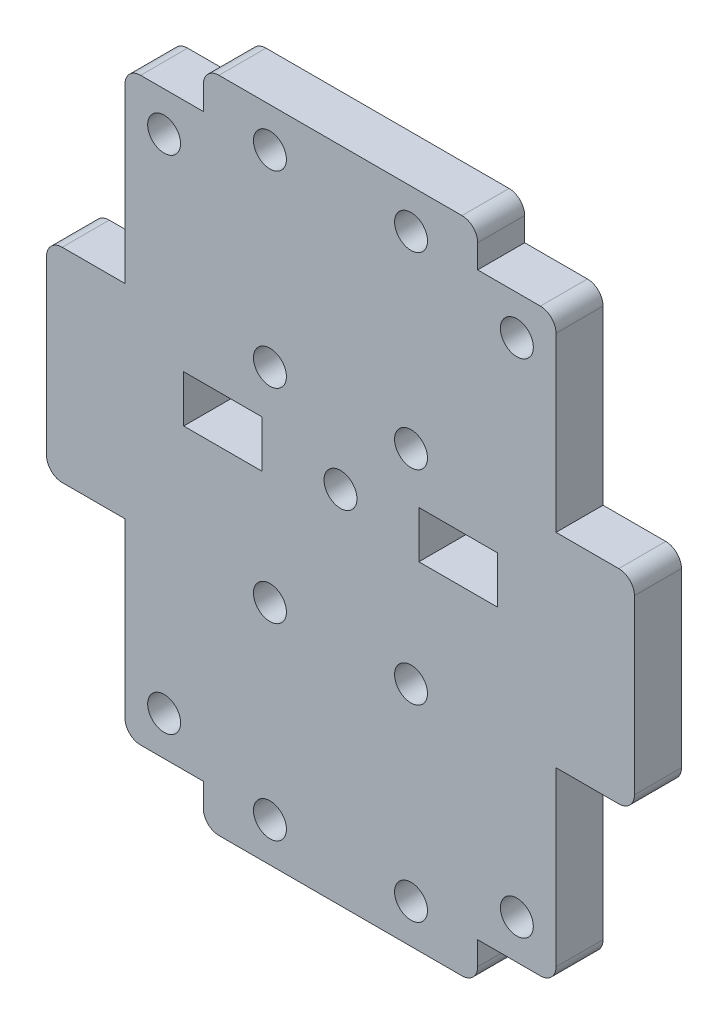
ISO-10303-21;
HEADER;
FILE_DESCRIPTION(('STEP AP214'),'2;1');
FILE_NAME('part.step','',(''),(''),'','','');
FILE_SCHEMA(('AUTOMOTIVE_DESIGN { 1 0 10303 214 1 1 1 1 }'));
ENDSEC;
DATA;
#1=APPLICATION_CONTEXT('core data for automotive mechanical design processes');
#2=APPLICATION_PROTOCOL_DEFINITION('international standard','automotive_design',2000,#1);
#3=PRODUCT_CONTEXT('',#1,'mechanical');
#4=PRODUCT('Part','Part','',(#3));
#5=PRODUCT_RELATED_PRODUCT_CATEGORY('part','',(#4));
#6=PRODUCT_DEFINITION_FORMATION('','',#4);
#7=PRODUCT_DEFINITION_CONTEXT('part definition',#1,'design');
#8=PRODUCT_DEFINITION('design','',#6,#7);
#9=PRODUCT_DEFINITION_SHAPE('','',#8);
#10=(LENGTH_UNIT() NAMED_UNIT(*) SI_UNIT(.MILLI.,.METRE.));
#11=(NAMED_UNIT(*) PLANE_ANGLE_UNIT() SI_UNIT($,.RADIAN.));
#12=(NAMED_UNIT(*) SI_UNIT($,.STERADIAN.) SOLID_ANGLE_UNIT());
#13=UNCERTAINTY_MEASURE_WITH_UNIT(LENGTH_MEASURE(1.E-05),#10,'distance_accuracy_value','');
#14=(GEOMETRIC_REPRESENTATION_CONTEXT(3) GLOBAL_UNCERTAINTY_ASSIGNED_CONTEXT((#13)) GLOBAL_UNIT_ASSIGNED_CONTEXT((#10,
#11,#12)) REPRESENTATION_CONTEXT('',''));
#15=CARTESIAN_POINT('',(0.,0.,0.));
#16=DIRECTION('',(0.,0.,1.));
#17=DIRECTION('',(1.,0.,0.));
#18=AXIS2_PLACEMENT_3D('',#15,#16,#17);
#19=CARTESIAN_POINT('',(0.,55.0000000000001,6.));
#20=DIRECTION('',(0.,-1.,0.));
#21=DIRECTION('',(0.,0.,-1.));
#22=AXIS2_PLACEMENT_3D('',#19,#20,#21);
#23=PLANE('',#22);
#24=DIRECTION('',(-1.,0.,0.));
#25=VECTOR('',#24,1.);
#26=CARTESIAN_POINT('',(0.,55.0000000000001,6.));
#27=LINE('',#26,#25);
#28=CARTESIAN_POINT('',(-9.99999999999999,55.,6.));
#29=VERTEX_POINT('',#28);
#30=CARTESIAN_POINT('',(-18.,55.0000000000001,6.));
#31=VERTEX_POINT('',#30);
#32=EDGE_CURVE('E434',#29,#31,#27,.T.);
#33=ORIENTED_EDGE('',*,*,#32,.F.);
#34=DIRECTION('',(0.,0.,1.));
#35=VECTOR('',#34,1.);
#36=CARTESIAN_POINT('',(-9.99999999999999,55.,-27.8567765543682));
#37=LINE('',#36,#35);
#38=CARTESIAN_POINT('',(-9.99999999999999,55.,0.));
#39=VERTEX_POINT('',#38);
#40=EDGE_CURVE('E391',#39,#29,#37,.T.);
#41=ORIENTED_EDGE('',*,*,#40,.F.);
#42=DIRECTION('',(-1.,0.,0.));
#43=VECTOR('',#42,1.);
#44=CARTESIAN_POINT('',(0.,55.0000000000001,0.));
#45=LINE('',#44,#43);
#46=CARTESIAN_POINT('',(-18.,55.0000000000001,0.));
#47=VERTEX_POINT('',#46);
#48=EDGE_CURVE('E527',#39,#47,#45,.T.);
#49=ORIENTED_EDGE('',*,*,#48,.T.);
#50=DIRECTION('',(0.,0.,-1.));
#51=VECTOR('',#50,1.);
#52=CARTESIAN_POINT('',(-18.,55.0000000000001,6.));
#53=LINE('',#52,#51);
#54=EDGE_CURVE('E11',#31,#47,#53,.T.);
#55=ORIENTED_EDGE('',*,*,#54,.F.);
#56=EDGE_LOOP('',(#33,#41,#49,#55));
#57=FACE_BOUND('',#56,.T.);
#58=ADVANCED_FACE('F37',(#57),#23,.F.);
#59=CARTESIAN_POINT('',(-18.,53.0000000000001,6.));
#60=DIRECTION('',(0.,0.,-1.));
#61=DIRECTION('',(-1.,0.,0.));
#62=AXIS2_PLACEMENT_3D('',#59,#60,#61);
#63=CYLINDRICAL_SURFACE('',#62,2.);
#64=CARTESIAN_POINT('',(-18.,53.0000000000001,0.));
#65=DIRECTION('',(0.,0.,1.));
#66=DIRECTION('',(1.,0.,0.));
#67=AXIS2_PLACEMENT_3D('',#64,#65,#66);
#68=CIRCLE('',#67,2.);
#69=CARTESIAN_POINT('',(-20.,53.0000000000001,0.));
#70=VERTEX_POINT('',#69);
#71=EDGE_CURVE('E529',#47,#70,#68,.T.);
#72=ORIENTED_EDGE('',*,*,#71,.T.);
#73=DIRECTION('',(0.,0.,-1.));
#74=VECTOR('',#73,1.);
#75=CARTESIAN_POINT('',(-20.,53.0000000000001,6.));
#76=LINE('',#75,#74);
#77=CARTESIAN_POINT('',(-20.,53.0000000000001,6.));
#78=VERTEX_POINT('',#77);
#79=EDGE_CURVE('E46',#78,#70,#76,.T.);
#80=ORIENTED_EDGE('',*,*,#79,.F.);
#81=CARTESIAN_POINT('',(-18.,53.0000000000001,6.));
#82=DIRECTION('',(0.,0.,1.));
#83=DIRECTION('',(1.,0.,0.));
#84=AXIS2_PLACEMENT_3D('',#81,#82,#83);
#85=CIRCLE('',#84,2.);
#86=EDGE_CURVE('E436',#31,#78,#85,.T.);
#87=ORIENTED_EDGE('',*,*,#86,.F.);
#88=ORIENTED_EDGE('',*,*,#54,.T.);
#89=EDGE_LOOP('',(#72,#80,#87,#88));
#90=FACE_BOUND('',#89,.T.);
#91=ADVANCED_FACE('F716',(#90),#63,.T.);
#92=CARTESIAN_POINT('',(-20.,0.,6.));
#93=DIRECTION('',(1.,0.,0.));
#94=DIRECTION('',(0.,0.,-1.));
#95=AXIS2_PLACEMENT_3D('',#92,#93,#94);
#96=PLANE('',#95);
#97=DIRECTION('',(0.,-1.,0.));
#98=VECTOR('',#97,1.);
#99=CARTESIAN_POINT('',(-20.,0.,0.));
#100=LINE('',#99,#98);
#101=CARTESIAN_POINT('',(-20.,31.,0.));
#102=VERTEX_POINT('',#101);
#103=EDGE_CURVE('E531',#70,#102,#100,.T.);
#104=ORIENTED_EDGE('',*,*,#103,.T.);
#105=DIRECTION('',(0.,0.,-1.));
#106=VECTOR('',#105,1.);
#107=CARTESIAN_POINT('',(-20.,31.,6.));
#108=LINE('',#107,#106);
#109=CARTESIAN_POINT('',(-20.,31.,6.));
#110=VERTEX_POINT('',#109);
#111=EDGE_CURVE('E635',#110,#102,#108,.T.);
#112=ORIENTED_EDGE('',*,*,#111,.F.);
#113=DIRECTION('',(0.,-1.,0.));
#114=VECTOR('',#113,1.);
#115=CARTESIAN_POINT('',(-20.,0.,6.));
#116=LINE('',#115,#114);
#117=EDGE_CURVE('E438',#78,#110,#116,.T.);
#118=ORIENTED_EDGE('',*,*,#117,.F.);
#119=ORIENTED_EDGE('',*,*,#79,.T.);
#120=EDGE_LOOP('',(#104,#112,#118,#119));
#121=FACE_BOUND('',#120,.T.);
#122=ADVANCED_FACE('F722',(#121),#96,.F.);
#123=CARTESIAN_POINT('',(-18.,31.,6.));
#124=DIRECTION('',(0.,0.,-1.));
#125=DIRECTION('',(-1.,0.,0.));
#126=AXIS2_PLACEMENT_3D('',#123,#124,#125);
#127=CYLINDRICAL_SURFACE('',#126,2.);
#128=CARTESIAN_POINT('',(-18.,31.,0.));
#129=DIRECTION('',(0.,0.,1.));
#130=DIRECTION('',(1.,0.,0.));
#131=AXIS2_PLACEMENT_3D('',#128,#129,#130);
#132=CIRCLE('',#131,2.);
#133=CARTESIAN_POINT('',(-18.,29.,0.));
#134=VERTEX_POINT('',#133);
#135=EDGE_CURVE('E534',#134,#102,#132,.F.);
#136=ORIENTED_EDGE('',*,*,#135,.F.);
#137=DIRECTION('',(0.,0.,-1.));
#138=VECTOR('',#137,1.);
#139=CARTESIAN_POINT('',(-18.,29.,6.));
#140=LINE('',#139,#138);
#141=CARTESIAN_POINT('',(-18.,29.,6.));
#142=VERTEX_POINT('',#141);
#143=EDGE_CURVE('E632',#142,#134,#140,.T.);
#144=ORIENTED_EDGE('',*,*,#143,.F.);
#145=CARTESIAN_POINT('',(-18.,31.,6.));
#146=DIRECTION('',(0.,0.,1.));
#147=DIRECTION('',(1.,0.,0.));
#148=AXIS2_PLACEMENT_3D('',#145,#146,#147);
#149=CIRCLE('',#148,2.);
#150=EDGE_CURVE('E440',#142,#110,#149,.F.);
#151=ORIENTED_EDGE('',*,*,#150,.T.);
#152=ORIENTED_EDGE('',*,*,#111,.T.);
#153=EDGE_LOOP('',(#136,#144,#151,#152));
#154=FACE_BOUND('',#153,.T.);
#155=ADVANCED_FACE('F885',(#154),#127,.T.);
#156=CARTESIAN_POINT('',(0.,29.,6.));
#157=DIRECTION('',(0.,-1.,0.));
#158=DIRECTION('',(1.,0.,0.));
#159=AXIS2_PLACEMENT_3D('',#156,#157,#158);
#160=PLANE('',#159);
#161=DIRECTION('',(0.,0.,1.));
#162=VECTOR('',#161,1.);
#163=CARTESIAN_POINT('',(-9.99999999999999,29.0000000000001,-27.8567765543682));
#164=LINE('',#163,#162);
#165=CARTESIAN_POINT('',(-9.99999999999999,29.0000000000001,0.));
#166=VERTEX_POINT('',#165);
#167=CARTESIAN_POINT('',(-9.99999999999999,29.0000000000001,6.));
#168=VERTEX_POINT('',#167);
#169=EDGE_CURVE('E333',#166,#168,#164,.T.);
#170=ORIENTED_EDGE('',*,*,#169,.T.);
#171=DIRECTION('',(-1.,0.,0.));
#172=VECTOR('',#171,1.);
#173=CARTESIAN_POINT('',(0.,29.,6.));
#174=LINE('',#173,#172);
#175=EDGE_CURVE('E443',#168,#142,#174,.T.);
#176=ORIENTED_EDGE('',*,*,#175,.T.);
#177=ORIENTED_EDGE('',*,*,#143,.T.);
#178=DIRECTION('',(-1.,0.,0.));
#179=VECTOR('',#178,1.);
#180=CARTESIAN_POINT('',(0.,29.,0.));
#181=LINE('',#180,#179);
#182=EDGE_CURVE('E537',#166,#134,#181,.T.);
#183=ORIENTED_EDGE('',*,*,#182,.F.);
#184=EDGE_LOOP('',(#170,#176,#177,#183));
#185=FACE_BOUND('',#184,.T.);
#186=ADVANCED_FACE('F877',(#185),#160,.T.);
#187=CARTESIAN_POINT('',(0.,0.,6.));
#188=DIRECTION('',(-1.,0.,0.));
#189=DIRECTION('',(0.,-1.,0.));
#190=AXIS2_PLACEMENT_3D('',#187,#188,#189);
#191=PLANE('',#190);
#192=DIRECTION('',(0.,0.,1.));
#193=VECTOR('',#192,1.);
#194=CARTESIAN_POINT('',(0.,5.0000000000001,-27.8567765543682));
#195=LINE('',#194,#193);
#196=CARTESIAN_POINT('',(0.,5.0000000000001,0.));
#197=VERTEX_POINT('',#196);
#198=CARTESIAN_POINT('',(0.,5.0000000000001,6.));
#199=VERTEX_POINT('',#198);
#200=EDGE_CURVE('E307',#197,#199,#195,.T.);
#201=ORIENTED_EDGE('',*,*,#200,.F.);
#202=DIRECTION('',(0.,1.,0.));
#203=VECTOR('',#202,1.);
#204=CARTESIAN_POINT('',(0.,0.,0.));
#205=LINE('',#204,#203);
#206=CARTESIAN_POINT('',(0.,2.00000000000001,0.));
#207=VERTEX_POINT('',#206);
#208=EDGE_CURVE('E539',#207,#197,#205,.T.);
#209=ORIENTED_EDGE('',*,*,#208,.F.);
#210=DIRECTION('',(0.,0.,-1.));
#211=VECTOR('',#210,1.);
#212=CARTESIAN_POINT('',(0.,2.00000000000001,6.));
#213=LINE('',#212,#211);
#214=CARTESIAN_POINT('',(0.,2.00000000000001,6.));
#215=VERTEX_POINT('',#214);
#216=EDGE_CURVE('E630',#215,#207,#213,.T.);
#217=ORIENTED_EDGE('',*,*,#216,.F.);
#218=DIRECTION('',(0.,1.,0.));
#219=VECTOR('',#218,1.);
#220=CARTESIAN_POINT('',(0.,0.,6.));
#221=LINE('',#220,#219);
#222=EDGE_CURVE('E445',#215,#199,#221,.T.);
#223=ORIENTED_EDGE('',*,*,#222,.T.);
#224=EDGE_LOOP('',(#201,#209,#217,#223));
#225=FACE_BOUND('',#224,.T.);
#226=ADVANCED_FACE('F869',(#225),#191,.T.);
#227=CARTESIAN_POINT('',(2.,2.,6.));
#228=DIRECTION('',(0.,0.,-1.));
#229=DIRECTION('',(-1.,0.,0.));
#230=AXIS2_PLACEMENT_3D('',#227,#228,#229);
#231=CYLINDRICAL_SURFACE('',#230,2.);
#232=CARTESIAN_POINT('',(2.,2.,0.));
#233=DIRECTION('',(0.,0.,1.));
#234=DIRECTION('',(1.,0.,0.));
#235=AXIS2_PLACEMENT_3D('',#232,#233,#234);
#236=CIRCLE('',#235,2.);
#237=CARTESIAN_POINT('',(2.00000000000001,0.,0.));
#238=VERTEX_POINT('',#237);
#239=EDGE_CURVE('E542',#238,#207,#236,.F.);
#240=ORIENTED_EDGE('',*,*,#239,.F.);
#241=DIRECTION('',(0.,0.,-1.));
#242=VECTOR('',#241,1.);
#243=CARTESIAN_POINT('',(2.00000000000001,0.,6.));
#244=LINE('',#243,#242);
#245=CARTESIAN_POINT('',(2.00000000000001,0.,6.));
#246=VERTEX_POINT('',#245);
#247=EDGE_CURVE('E628',#246,#238,#244,.T.);
#248=ORIENTED_EDGE('',*,*,#247,.F.);
#249=CARTESIAN_POINT('',(2.,2.,6.));
#250=DIRECTION('',(0.,0.,1.));
#251=DIRECTION('',(1.,0.,0.));
#252=AXIS2_PLACEMENT_3D('',#249,#250,#251);
#253=CIRCLE('',#252,2.);
#254=EDGE_CURVE('E447',#246,#215,#253,.F.);
#255=ORIENTED_EDGE('',*,*,#254,.T.);
#256=ORIENTED_EDGE('',*,*,#216,.T.);
#257=EDGE_LOOP('',(#240,#248,#255,#256));
#258=FACE_BOUND('',#257,.T.);
#259=ADVANCED_FACE('F861',(#258),#231,.T.);
#260=CARTESIAN_POINT('',(0.,0.,6.));
#261=DIRECTION('',(0.,1.,0.));
#262=DIRECTION('',(0.,0.,1.));
#263=AXIS2_PLACEMENT_3D('',#260,#261,#262);
#264=PLANE('',#263);
#265=DIRECTION('',(1.,0.,0.));
#266=VECTOR('',#265,1.);
#267=CARTESIAN_POINT('',(0.,0.,0.));
#268=LINE('',#267,#266);
#269=CARTESIAN_POINT('',(33.,0.,0.));
#270=VERTEX_POINT('',#269);
#271=EDGE_CURVE('E546',#238,#270,#268,.T.);
#272=ORIENTED_EDGE('',*,*,#271,.T.);
#273=DIRECTION('',(0.,0.,-1.));
#274=VECTOR('',#273,1.);
#275=CARTESIAN_POINT('',(33.,0.,6.));
#276=LINE('',#275,#274);
#277=CARTESIAN_POINT('',(33.,0.,6.));
#278=VERTEX_POINT('',#277);
#279=EDGE_CURVE('E625',#278,#270,#276,.T.);
#280=ORIENTED_EDGE('',*,*,#279,.F.);
#281=DIRECTION('',(1.,0.,0.));
#282=VECTOR('',#281,1.);
#283=CARTESIAN_POINT('',(0.,0.,6.));
#284=LINE('',#283,#282);
#285=EDGE_CURVE('E451',#246,#278,#284,.T.);
#286=ORIENTED_EDGE('',*,*,#285,.F.);
#287=ORIENTED_EDGE('',*,*,#247,.T.);
#288=EDGE_LOOP('',(#272,#280,#286,#287));
#289=FACE_BOUND('',#288,.T.);
#290=ADVANCED_FACE('F853',(#289),#264,.F.);
#291=CARTESIAN_POINT('',(33.,2.,6.));
#292=DIRECTION('',(0.,0.,-1.));
#293=DIRECTION('',(-1.,0.,0.));
#294=AXIS2_PLACEMENT_3D('',#291,#292,#293);
#295=CYLINDRICAL_SURFACE('',#294,2.);
#296=CARTESIAN_POINT('',(33.,2.,0.));
#297=DIRECTION('',(0.,0.,1.));
#298=DIRECTION('',(1.,0.,0.));
#299=AXIS2_PLACEMENT_3D('',#296,#297,#298);
#300=CIRCLE('',#299,2.);
#301=CARTESIAN_POINT('',(35.,2.00000000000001,0.));
#302=VERTEX_POINT('',#301);
#303=EDGE_CURVE('E548',#270,#302,#300,.T.);
#304=ORIENTED_EDGE('',*,*,#303,.T.);
#305=DIRECTION('',(0.,0.,-1.));
#306=VECTOR('',#305,1.);
#307=CARTESIAN_POINT('',(35.,2.00000000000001,6.));
#308=LINE('',#307,#306);
#309=CARTESIAN_POINT('',(35.,2.00000000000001,6.));
#310=VERTEX_POINT('',#309);
#311=EDGE_CURVE('E622',#310,#302,#308,.T.);
#312=ORIENTED_EDGE('',*,*,#311,.F.);
#313=CARTESIAN_POINT('',(33.,2.,6.));
#314=DIRECTION('',(0.,0.,1.));
#315=DIRECTION('',(1.,0.,0.));
#316=AXIS2_PLACEMENT_3D('',#313,#314,#315);
#317=CIRCLE('',#316,2.);
#318=EDGE_CURVE('E453',#278,#310,#317,.T.);
#319=ORIENTED_EDGE('',*,*,#318,.F.);
#320=ORIENTED_EDGE('',*,*,#279,.T.);
#321=EDGE_LOOP('',(#304,#312,#319,#320));
#322=FACE_BOUND('',#321,.T.);
#323=ADVANCED_FACE('F847',(#322),#295,.T.);
#324=CARTESIAN_POINT('',(35.,0.,6.));
#325=DIRECTION('',(-1.,0.,0.));
#326=DIRECTION('',(0.,-1.,0.));
#327=AXIS2_PLACEMENT_3D('',#324,#325,#326);
#328=PLANE('',#327);
#329=DIRECTION('',(0.,1.,0.));
#330=VECTOR('',#329,1.);
#331=CARTESIAN_POINT('',(35.,0.,0.));
#332=LINE('',#331,#330);
#333=CARTESIAN_POINT('',(35.,5.0000000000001,0.));
#334=VERTEX_POINT('',#333);
#335=EDGE_CURVE('E550',#302,#334,#332,.T.);
#336=ORIENTED_EDGE('',*,*,#335,.T.);
#337=DIRECTION('',(0.,0.,1.));
#338=VECTOR('',#337,1.);
#339=CARTESIAN_POINT('',(35.,5.0000000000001,-27.8567765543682));
#340=LINE('',#339,#338);
#341=CARTESIAN_POINT('',(35.,5.0000000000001,6.));
#342=VERTEX_POINT('',#341);
#343=EDGE_CURVE('E62',#334,#342,#340,.T.);
#344=ORIENTED_EDGE('',*,*,#343,.T.);
#345=DIRECTION('',(0.,1.,0.));
#346=VECTOR('',#345,1.);
#347=CARTESIAN_POINT('',(35.,0.,6.));
#348=LINE('',#347,#346);
#349=EDGE_CURVE('E455',#310,#342,#348,.T.);
#350=ORIENTED_EDGE('',*,*,#349,.F.);
#351=ORIENTED_EDGE('',*,*,#311,.T.);
#352=EDGE_LOOP('',(#336,#344,#350,#351));
#353=FACE_BOUND('',#352,.T.);
#354=ADVANCED_FACE('F802',(#353),#328,.F.);
#355=CARTESIAN_POINT('',(0.,29.,6.));
#356=DIRECTION('',(0.,1.,0.));
#357=DIRECTION('',(-1.,0.,0.));
#358=AXIS2_PLACEMENT_3D('',#355,#356,#357);
#359=PLANE('',#358);
#360=DIRECTION('',(1.,0.,0.));
#361=VECTOR('',#360,1.);
#362=CARTESIAN_POINT('',(0.,29.,6.));
#363=LINE('',#362,#361);
#364=CARTESIAN_POINT('',(45.,29.,6.));
#365=VERTEX_POINT('',#364);
#366=CARTESIAN_POINT('',(53.,29.,6.));
#367=VERTEX_POINT('',#366);
#368=EDGE_CURVE('E54',#365,#367,#363,.T.);
#369=ORIENTED_EDGE('',*,*,#368,.F.);
#370=DIRECTION('',(0.,0.,1.));
#371=VECTOR('',#370,1.);
#372=CARTESIAN_POINT('',(45.,29.0000000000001,-27.8567765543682));
#373=LINE('',#372,#371);
#374=CARTESIAN_POINT('',(45.,29.,0.));
#375=VERTEX_POINT('',#374);
#376=EDGE_CURVE('E344',#375,#365,#373,.T.);
#377=ORIENTED_EDGE('',*,*,#376,.F.);
#378=DIRECTION('',(1.,0.,0.));
#379=VECTOR('',#378,1.);
#380=CARTESIAN_POINT('',(0.,29.,0.));
#381=LINE('',#380,#379);
#382=CARTESIAN_POINT('',(53.,29.,0.));
#383=VERTEX_POINT('',#382);
#384=EDGE_CURVE('E552',#375,#383,#381,.T.);
#385=ORIENTED_EDGE('',*,*,#384,.T.);
#386=DIRECTION('',(0.,0.,-1.));
#387=VECTOR('',#386,1.);
#388=CARTESIAN_POINT('',(53.,29.,6.));
#389=LINE('',#388,#387);
#390=EDGE_CURVE('E619',#367,#383,#389,.T.);
#391=ORIENTED_EDGE('',*,*,#390,.F.);
#392=EDGE_LOOP('',(#369,#377,#385,#391));
#393=FACE_BOUND('',#392,.T.);
#394=ADVANCED_FACE('F833',(#393),#359,.F.);
#395=CARTESIAN_POINT('',(53.,31.,6.));
#396=DIRECTION('',(0.,0.,-1.));
#397=DIRECTION('',(-1.,0.,0.));
#398=AXIS2_PLACEMENT_3D('',#395,#396,#397);
#399=CYLINDRICAL_SURFACE('',#398,2.);
#400=CARTESIAN_POINT('',(53.,31.,0.));
#401=DIRECTION('',(0.,0.,1.));
#402=DIRECTION('',(1.,0.,0.));
#403=AXIS2_PLACEMENT_3D('',#400,#401,#402);
#404=CIRCLE('',#403,2.);
#405=CARTESIAN_POINT('',(55.,31.,0.));
#406=VERTEX_POINT('',#405);
#407=EDGE_CURVE('E555',#383,#406,#404,.T.);
#408=ORIENTED_EDGE('',*,*,#407,.T.);
#409=DIRECTION('',(0.,0.,-1.));
#410=VECTOR('',#409,1.);
#411=CARTESIAN_POINT('',(55.,31.,6.));
#412=LINE('',#411,#410);
#413=CARTESIAN_POINT('',(55.,31.,6.));
#414=VERTEX_POINT('',#413);
#415=EDGE_CURVE('E617',#414,#406,#412,.T.);
#416=ORIENTED_EDGE('',*,*,#415,.F.);
#417=CARTESIAN_POINT('',(53.,31.,6.));
#418=DIRECTION('',(0.,0.,1.));
#419=DIRECTION('',(1.,0.,0.));
#420=AXIS2_PLACEMENT_3D('',#417,#418,#419);
#421=CIRCLE('',#420,2.);
#422=EDGE_CURVE('E459',#367,#414,#421,.T.);
#423=ORIENTED_EDGE('',*,*,#422,.F.);
#424=ORIENTED_EDGE('',*,*,#390,.T.);
#425=EDGE_LOOP('',(#408,#416,#423,#424));
#426=FACE_BOUND('',#425,.T.);
#427=ADVANCED_FACE('F825',(#426),#399,.T.);
#428=CARTESIAN_POINT('',(54.9999999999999,0.,6.));
#429=DIRECTION('',(1.,0.,0.));
#430=DIRECTION('',(0.,1.,0.));
#431=AXIS2_PLACEMENT_3D('',#428,#429,#430);
#432=PLANE('',#431);
#433=DIRECTION('',(0.,-1.,0.));
#434=VECTOR('',#433,1.);
#435=CARTESIAN_POINT('',(54.9999999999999,0.,0.));
#436=LINE('',#435,#434);
#437=CARTESIAN_POINT('',(55.,53.0000000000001,0.));
#438=VERTEX_POINT('',#437);
#439=EDGE_CURVE('E558',#438,#406,#436,.T.);
#440=ORIENTED_EDGE('',*,*,#439,.F.);
#441=DIRECTION('',(0.,0.,-1.));
#442=VECTOR('',#441,1.);
#443=CARTESIAN_POINT('',(55.,53.0000000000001,6.));
#444=LINE('',#443,#442);
#445=CARTESIAN_POINT('',(55.,53.0000000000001,6.));
#446=VERTEX_POINT('',#445);
#447=EDGE_CURVE('E615',#446,#438,#444,.T.);
#448=ORIENTED_EDGE('',*,*,#447,.F.);
#449=DIRECTION('',(0.,-1.,0.));
#450=VECTOR('',#449,1.);
#451=CARTESIAN_POINT('',(54.9999999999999,0.,6.));
#452=LINE('',#451,#450);
#453=EDGE_CURVE('E461',#446,#414,#452,.T.);
#454=ORIENTED_EDGE('',*,*,#453,.T.);
#455=ORIENTED_EDGE('',*,*,#415,.T.);
#456=EDGE_LOOP('',(#440,#448,#454,#455));
#457=FACE_BOUND('',#456,.T.);
#458=ADVANCED_FACE('F817',(#457),#432,.T.);
#459=CARTESIAN_POINT('',(53.,53.0000000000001,6.));
#460=DIRECTION('',(0.,0.,-1.));
#461=DIRECTION('',(-1.,0.,0.));
#462=AXIS2_PLACEMENT_3D('',#459,#460,#461);
#463=CYLINDRICAL_SURFACE('',#462,2.);
#464=CARTESIAN_POINT('',(53.,53.0000000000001,0.));
#465=DIRECTION('',(0.,0.,1.));
#466=DIRECTION('',(1.,0.,0.));
#467=AXIS2_PLACEMENT_3D('',#464,#465,#466);
#468=CIRCLE('',#467,2.);
#469=CARTESIAN_POINT('',(53.,55.0000000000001,0.));
#470=VERTEX_POINT('',#469);
#471=EDGE_CURVE('E561',#470,#438,#468,.F.);
#472=ORIENTED_EDGE('',*,*,#471,.F.);
#473=DIRECTION('',(0.,0.,-1.));
#474=VECTOR('',#473,1.);
#475=CARTESIAN_POINT('',(53.,55.0000000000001,6.));
#476=LINE('',#475,#474);
#477=CARTESIAN_POINT('',(53.,55.0000000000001,6.));
#478=VERTEX_POINT('',#477);
#479=EDGE_CURVE('E612',#478,#470,#476,.T.);
#480=ORIENTED_EDGE('',*,*,#479,.F.);
#481=CARTESIAN_POINT('',(53.,53.0000000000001,6.));
#482=DIRECTION('',(0.,0.,1.));
#483=DIRECTION('',(1.,0.,0.));
#484=AXIS2_PLACEMENT_3D('',#481,#482,#483);
#485=CIRCLE('',#484,2.);
#486=EDGE_CURVE('E464',#478,#446,#485,.F.);
#487=ORIENTED_EDGE('',*,*,#486,.T.);
#488=ORIENTED_EDGE('',*,*,#447,.T.);
#489=EDGE_LOOP('',(#472,#480,#487,#488));
#490=FACE_BOUND('',#489,.T.);
#491=ADVANCED_FACE('F809',(#490),#463,.T.);
#492=CARTESIAN_POINT('',(0.,55.0000000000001,6.));
#493=DIRECTION('',(0.,1.,0.));
#494=DIRECTION('',(0.,0.,1.));
#495=AXIS2_PLACEMENT_3D('',#492,#493,#494);
#496=PLANE('',#495);
#497=DIRECTION('',(0.,0.,1.));
#498=VECTOR('',#497,1.);
#499=CARTESIAN_POINT('',(45.,55.,-27.8567765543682));
#500=LINE('',#499,#498);
#501=CARTESIAN_POINT('',(45.,55.0000000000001,0.));
#502=VERTEX_POINT('',#501);
#503=CARTESIAN_POINT('',(45.,55.0000000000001,6.));
#504=VERTEX_POINT('',#503);
#505=EDGE_CURVE('E380',#502,#504,#500,.T.);
#506=ORIENTED_EDGE('',*,*,#505,.T.);
#507=DIRECTION('',(1.,0.,0.));
#508=VECTOR('',#507,1.);
#509=CARTESIAN_POINT('',(0.,55.0000000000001,6.));
#510=LINE('',#509,#508);
#511=EDGE_CURVE('E467',#504,#478,#510,.T.);
#512=ORIENTED_EDGE('',*,*,#511,.T.);
#513=ORIENTED_EDGE('',*,*,#479,.T.);
#514=DIRECTION('',(1.,0.,0.));
#515=VECTOR('',#514,1.);
#516=CARTESIAN_POINT('',(0.,55.0000000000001,0.));
#517=LINE('',#516,#515);
#518=EDGE_CURVE('E564',#502,#470,#517,.T.);
#519=ORIENTED_EDGE('',*,*,#518,.F.);
#520=EDGE_LOOP('',(#506,#512,#513,#519));
#521=FACE_BOUND('',#520,.T.);
#522=ADVANCED_FACE('F799',(#521),#496,.T.);
#523=CARTESIAN_POINT('',(35.,79.,6.));
#524=VERTEX_POINT('',#523);
#525=CARTESIAN_POINT('',(35.,82.,6.));
#526=VERTEX_POINT('',#525);
#527=EDGE_CURVE('E457',#524,#526,#348,.T.);
#528=ORIENTED_EDGE('',*,*,#527,.F.);
#529=DIRECTION('',(0.,0.,1.));
#530=VECTOR('',#529,1.);
#531=CARTESIAN_POINT('',(35.,79.,-27.8567765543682));
#532=LINE('',#531,#530);
#533=CARTESIAN_POINT('',(35.,79.,0.));
#534=VERTEX_POINT('',#533);
#535=EDGE_CURVE('E382',#534,#524,#532,.T.);
#536=ORIENTED_EDGE('',*,*,#535,.F.);
#537=CARTESIAN_POINT('',(35.,82.,0.));
#538=VERTEX_POINT('',#537);
#539=EDGE_CURVE('E553',#534,#538,#332,.T.);
#540=ORIENTED_EDGE('',*,*,#539,.T.);
#541=DIRECTION('',(0.,0.,-1.));
#542=VECTOR('',#541,1.);
#543=CARTESIAN_POINT('',(35.,82.,6.));
#544=LINE('',#543,#542);
#545=EDGE_CURVE('E609',#526,#538,#544,.T.);
#546=ORIENTED_EDGE('',*,*,#545,.F.);
#547=EDGE_LOOP('',(#528,#536,#540,#546));
#548=FACE_BOUND('',#547,.T.);
#549=ADVANCED_FACE('F790',(#548),#328,.F.);
#550=CARTESIAN_POINT('',(33.,82.,6.));
#551=DIRECTION('',(0.,0.,-1.));
#552=DIRECTION('',(-1.,0.,0.));
#553=AXIS2_PLACEMENT_3D('',#550,#551,#552);
#554=CYLINDRICAL_SURFACE('',#553,2.);
#555=CARTESIAN_POINT('',(33.,82.,0.));
#556=DIRECTION('',(0.,0.,1.));
#557=DIRECTION('',(1.,0.,0.));
#558=AXIS2_PLACEMENT_3D('',#555,#556,#557);
#559=CIRCLE('',#558,2.);
#560=CARTESIAN_POINT('',(33.,84.,0.));
#561=VERTEX_POINT('',#560);
#562=EDGE_CURVE('E566',#561,#538,#559,.F.);
#563=ORIENTED_EDGE('',*,*,#562,.F.);
#564=DIRECTION('',(0.,0.,-1.));
#565=VECTOR('',#564,1.);
#566=CARTESIAN_POINT('',(33.,84.,6.));
#567=LINE('',#566,#565);
#568=CARTESIAN_POINT('',(33.,84.,6.));
#569=VERTEX_POINT('',#568);
#570=EDGE_CURVE('E607',#569,#561,#567,.T.);
#571=ORIENTED_EDGE('',*,*,#570,.F.);
#572=CARTESIAN_POINT('',(33.,82.,6.));
#573=DIRECTION('',(0.,0.,1.));
#574=DIRECTION('',(1.,0.,0.));
#575=AXIS2_PLACEMENT_3D('',#572,#573,#574);
#576=CIRCLE('',#575,2.);
#577=EDGE_CURVE('E469',#569,#526,#576,.F.);
#578=ORIENTED_EDGE('',*,*,#577,.T.);
#579=ORIENTED_EDGE('',*,*,#545,.T.);
#580=EDGE_LOOP('',(#563,#571,#578,#579));
#581=FACE_BOUND('',#580,.T.);
#582=ADVANCED_FACE('F782',(#581),#554,.T.);
#583=CARTESIAN_POINT('',(0.,84.,6.));
#584=DIRECTION('',(0.,1.,0.));
#585=DIRECTION('',(0.,0.,1.));
#586=AXIS2_PLACEMENT_3D('',#583,#584,#585);
#587=PLANE('',#586);
#588=DIRECTION('',(1.,0.,0.));
#589=VECTOR('',#588,1.);
#590=CARTESIAN_POINT('',(0.,84.,0.));
#591=LINE('',#590,#589);
#592=CARTESIAN_POINT('',(2.,84.,0.));
#593=VERTEX_POINT('',#592);
#594=EDGE_CURVE('E569',#593,#561,#591,.T.);
#595=ORIENTED_EDGE('',*,*,#594,.F.);
#596=DIRECTION('',(0.,0.,-1.));
#597=VECTOR('',#596,1.);
#598=CARTESIAN_POINT('',(2.,84.,6.));
#599=LINE('',#598,#597);
#600=CARTESIAN_POINT('',(2.,84.,6.));
#601=VERTEX_POINT('',#600);
#602=EDGE_CURVE('E604',#601,#593,#599,.T.);
#603=ORIENTED_EDGE('',*,*,#602,.F.);
#604=DIRECTION('',(1.,0.,0.));
#605=VECTOR('',#604,1.);
#606=CARTESIAN_POINT('',(0.,84.,6.));
#607=LINE('',#606,#605);
#608=EDGE_CURVE('E472',#601,#569,#607,.T.);
#609=ORIENTED_EDGE('',*,*,#608,.T.);
#610=ORIENTED_EDGE('',*,*,#570,.T.);
#611=EDGE_LOOP('',(#595,#603,#609,#610));
#612=FACE_BOUND('',#611,.T.);
#613=ADVANCED_FACE('F774',(#612),#587,.T.);
#614=CARTESIAN_POINT('',(2.,82.,6.));
#615=DIRECTION('',(0.,0.,-1.));
#616=DIRECTION('',(-1.,0.,0.));
#617=AXIS2_PLACEMENT_3D('',#614,#615,#616);
#618=CYLINDRICAL_SURFACE('',#617,2.);
#619=CARTESIAN_POINT('',(2.,82.,0.));
#620=DIRECTION('',(0.,0.,1.));
#621=DIRECTION('',(1.,0.,0.));
#622=AXIS2_PLACEMENT_3D('',#619,#620,#621);
#623=CIRCLE('',#622,2.);
#624=CARTESIAN_POINT('',(0.,82.,0.));
#625=VERTEX_POINT('',#624);
#626=EDGE_CURVE('E572',#625,#593,#623,.F.);
#627=ORIENTED_EDGE('',*,*,#626,.F.);
#628=DIRECTION('',(0.,0.,-1.));
#629=VECTOR('',#628,1.);
#630=CARTESIAN_POINT('',(0.,82.,6.));
#631=LINE('',#630,#629);
#632=CARTESIAN_POINT('',(0.,82.,6.));
#633=VERTEX_POINT('',#632);
#634=EDGE_CURVE('E601',#633,#625,#631,.T.);
#635=ORIENTED_EDGE('',*,*,#634,.F.);
#636=CARTESIAN_POINT('',(2.,82.,6.));
#637=DIRECTION('',(0.,0.,1.));
#638=DIRECTION('',(1.,0.,0.));
#639=AXIS2_PLACEMENT_3D('',#636,#637,#638);
#640=CIRCLE('',#639,2.);
#641=EDGE_CURVE('E475',#633,#601,#640,.F.);
#642=ORIENTED_EDGE('',*,*,#641,.T.);
#643=ORIENTED_EDGE('',*,*,#602,.T.);
#644=EDGE_LOOP('',(#627,#635,#642,#643));
#645=FACE_BOUND('',#644,.T.);
#646=ADVANCED_FACE('F744',(#645),#618,.T.);
#647=CARTESIAN_POINT('',(7.5,0.,6.));
#648=DIRECTION('',(1.,0.,0.));
#649=DIRECTION('',(0.,0.,-1.));
#650=AXIS2_PLACEMENT_3D('',#647,#648,#649);
#651=PLANE('',#650);
#652=DIRECTION('',(0.,-1.,0.));
#653=VECTOR('',#652,1.);
#654=CARTESIAN_POINT('',(7.5,0.,0.));
#655=LINE('',#654,#653);
#656=CARTESIAN_POINT('',(7.5,49.,0.));
#657=VERTEX_POINT('',#656);
#658=CARTESIAN_POINT('',(7.5,43.,0.));
#659=VERTEX_POINT('',#658);
#660=EDGE_CURVE('E516',#657,#659,#655,.T.);
#661=ORIENTED_EDGE('',*,*,#660,.T.);
#662=DIRECTION('',(0.,0.,-1.));
#663=VECTOR('',#662,1.);
#664=CARTESIAN_POINT('',(7.5,43.,6.));
#665=LINE('',#664,#663);
#666=CARTESIAN_POINT('',(7.5,43.,6.));
#667=VERTEX_POINT('',#666);
#668=EDGE_CURVE('E605',#667,#659,#665,.T.);
#669=ORIENTED_EDGE('',*,*,#668,.F.);
#670=DIRECTION('',(0.,-1.,0.));
#671=VECTOR('',#670,1.);
#672=CARTESIAN_POINT('',(7.5,0.,6.));
#673=LINE('',#672,#671);
#674=CARTESIAN_POINT('',(7.5,49.,6.));
#675=VERTEX_POINT('',#674);
#676=EDGE_CURVE('E424',#675,#667,#673,.T.);
#677=ORIENTED_EDGE('',*,*,#676,.F.);
#678=DIRECTION('',(0.,0.,-1.));
#679=VECTOR('',#678,1.);
#680=CARTESIAN_POINT('',(7.5,49.,6.));
#681=LINE('',#680,#679);
#682=EDGE_CURVE('E639',#675,#657,#681,.T.);
#683=ORIENTED_EDGE('',*,*,#682,.T.);
#684=EDGE_LOOP('',(#661,#669,#677,#683));
#685=FACE_BOUND('',#684,.T.);
#686=ADVANCED_FACE('F740',(#685),#651,.F.);
#687=CARTESIAN_POINT('',(0.,43.,6.));
#688=DIRECTION('',(0.,1.,0.));
#689=DIRECTION('',(-1.,0.,0.));
#690=AXIS2_PLACEMENT_3D('',#687,#688,#689);
#691=PLANE('',#690);
#692=DIRECTION('',(1.,0.,0.));
#693=VECTOR('',#692,1.);
#694=CARTESIAN_POINT('',(0.,43.,0.));
#695=LINE('',#694,#693);
#696=CARTESIAN_POINT('',(-2.5,43.,0.));
#697=VERTEX_POINT('',#696);
#698=EDGE_CURVE('E519',#697,#659,#695,.T.);
#699=ORIENTED_EDGE('',*,*,#698,.F.);
#700=DIRECTION('',(0.,0.,-1.));
#701=VECTOR('',#700,1.);
#702=CARTESIAN_POINT('',(-2.5,43.,6.));
#703=LINE('',#702,#701);
#704=CARTESIAN_POINT('',(-2.5,43.,6.));
#705=VERTEX_POINT('',#704);
#706=EDGE_CURVE('E644',#705,#697,#703,.T.);
#707=ORIENTED_EDGE('',*,*,#706,.F.);
#708=DIRECTION('',(1.,0.,0.));
#709=VECTOR('',#708,1.);
#710=CARTESIAN_POINT('',(0.,43.,6.));
#711=LINE('',#710,#709);
#712=EDGE_CURVE('E426',#705,#667,#711,.T.);
#713=ORIENTED_EDGE('',*,*,#712,.T.);
#714=ORIENTED_EDGE('',*,*,#668,.T.);
#715=EDGE_LOOP('',(#699,#707,#713,#714));
#716=FACE_BOUND('',#715,.T.);
#717=ADVANCED_FACE('F736',(#716),#691,.T.);
#718=CARTESIAN_POINT('',(-2.5,0.,6.));
#719=DIRECTION('',(1.,0.,0.));
#720=DIRECTION('',(0.,0.,-1.));
#721=AXIS2_PLACEMENT_3D('',#718,#719,#720);
#722=PLANE('',#721);
#723=DIRECTION('',(0.,-1.,0.));
#724=VECTOR('',#723,1.);
#725=CARTESIAN_POINT('',(-2.5,0.,0.));
#726=LINE('',#725,#724);
#727=CARTESIAN_POINT('',(-2.5,49.,0.));
#728=VERTEX_POINT('',#727);
#729=EDGE_CURVE('E522',#728,#697,#726,.T.);
#730=ORIENTED_EDGE('',*,*,#729,.F.);
#731=DIRECTION('',(0.,0.,-1.));
#732=VECTOR('',#731,1.);
#733=CARTESIAN_POINT('',(-2.5,49.,6.));
#734=LINE('',#733,#732);
#735=CARTESIAN_POINT('',(-2.5,49.,6.));
#736=VERTEX_POINT('',#735);
#737=EDGE_CURVE('E642',#736,#728,#734,.T.);
#738=ORIENTED_EDGE('',*,*,#737,.F.);
#739=DIRECTION('',(0.,-1.,0.));
#740=VECTOR('',#739,1.);
#741=CARTESIAN_POINT('',(-2.5,0.,6.));
#742=LINE('',#741,#740);
#743=EDGE_CURVE('E429',#736,#705,#742,.T.);
#744=ORIENTED_EDGE('',*,*,#743,.T.);
#745=ORIENTED_EDGE('',*,*,#706,.T.);
#746=EDGE_LOOP('',(#730,#738,#744,#745));
#747=FACE_BOUND('',#746,.T.);
#748=ADVANCED_FACE('F733',(#747),#722,.T.);
#749=CARTESIAN_POINT('',(37.5,0.,6.));
#750=DIRECTION('',(1.,0.,0.));
#751=DIRECTION('',(0.,0.,-1.));
#752=AXIS2_PLACEMENT_3D('',#749,#750,#751);
#753=PLANE('',#752);
#754=DIRECTION('',(0.,-1.,0.));
#755=VECTOR('',#754,1.);
#756=CARTESIAN_POINT('',(37.5,0.,0.));
#757=LINE('',#756,#755);
#758=CARTESIAN_POINT('',(37.5,49.,0.));
#759=VERTEX_POINT('',#758);
#760=CARTESIAN_POINT('',(37.5,43.,0.));
#761=VERTEX_POINT('',#760);
#762=EDGE_CURVE('E412',#759,#761,#757,.T.);
#763=ORIENTED_EDGE('',*,*,#762,.T.);
#764=DIRECTION('',(0.,0.,-1.));
#765=VECTOR('',#764,1.);
#766=CARTESIAN_POINT('',(37.5,43.,6.));
#767=LINE('',#766,#765);
#768=CARTESIAN_POINT('',(37.5,43.,6.));
#769=VERTEX_POINT('',#768);
#770=EDGE_CURVE('E41',#769,#761,#767,.T.);
#771=ORIENTED_EDGE('',*,*,#770,.F.);
#772=DIRECTION('',(0.,-1.,0.));
#773=VECTOR('',#772,1.);
#774=CARTESIAN_POINT('',(37.5,0.,6.));
#775=LINE('',#774,#773);
#776=CARTESIAN_POINT('',(37.5,49.,6.));
#777=VERTEX_POINT('',#776);
#778=EDGE_CURVE('E413',#777,#769,#775,.T.);
#779=ORIENTED_EDGE('',*,*,#778,.F.);
#780=DIRECTION('',(0.,0.,-1.));
#781=VECTOR('',#780,1.);
#782=CARTESIAN_POINT('',(37.5,49.,6.));
#783=LINE('',#782,#781);
#784=EDGE_CURVE('E505',#777,#759,#783,.T.);
#785=ORIENTED_EDGE('',*,*,#784,.T.);
#786=EDGE_LOOP('',(#763,#771,#779,#785));
#787=FACE_BOUND('',#786,.T.);
#788=ADVANCED_FACE('F39',(#787),#753,.F.);
#789=CARTESIAN_POINT('',(0.,43.,6.));
#790=DIRECTION('',(0.,1.,0.));
#791=DIRECTION('',(-1.,0.,0.));
#792=AXIS2_PLACEMENT_3D('',#789,#790,#791);
#793=PLANE('',#792);
#794=DIRECTION('',(1.,0.,0.));
#795=VECTOR('',#794,1.);
#796=CARTESIAN_POINT('',(0.,43.,0.));
#797=LINE('',#796,#795);
#798=CARTESIAN_POINT('',(27.5,43.,0.));
#799=VERTEX_POINT('',#798);
#800=EDGE_CURVE('E508',#799,#761,#797,.T.);
#801=ORIENTED_EDGE('',*,*,#800,.F.);
#802=DIRECTION('',(0.,0.,-1.));
#803=VECTOR('',#802,1.);
#804=CARTESIAN_POINT('',(27.5,43.,6.));
#805=LINE('',#804,#803);
#806=CARTESIAN_POINT('',(27.5,43.,6.));
#807=VERTEX_POINT('',#806);
#808=EDGE_CURVE('E650',#807,#799,#805,.T.);
#809=ORIENTED_EDGE('',*,*,#808,.F.);
#810=DIRECTION('',(1.,0.,0.));
#811=VECTOR('',#810,1.);
#812=CARTESIAN_POINT('',(0.,43.,6.));
#813=LINE('',#812,#811);
#814=EDGE_CURVE('E415',#807,#769,#813,.T.);
#815=ORIENTED_EDGE('',*,*,#814,.T.);
#816=ORIENTED_EDGE('',*,*,#770,.T.);
#817=EDGE_LOOP('',(#801,#809,#815,#816));
#818=FACE_BOUND('',#817,.T.);
#819=ADVANCED_FACE('F656',(#818),#793,.T.);
#820=CARTESIAN_POINT('',(27.5,0.,6.));
#821=DIRECTION('',(1.,0.,0.));
#822=DIRECTION('',(0.,0.,-1.));
#823=AXIS2_PLACEMENT_3D('',#820,#821,#822);
#824=PLANE('',#823);
#825=DIRECTION('',(0.,-1.,0.));
#826=VECTOR('',#825,1.);
#827=CARTESIAN_POINT('',(27.5,0.,0.));
#828=LINE('',#827,#826);
#829=CARTESIAN_POINT('',(27.5,49.,0.));
#830=VERTEX_POINT('',#829);
#831=EDGE_CURVE('E511',#830,#799,#828,.T.);
#832=ORIENTED_EDGE('',*,*,#831,.F.);
#833=DIRECTION('',(0.,0.,-1.));
#834=VECTOR('',#833,1.);
#835=CARTESIAN_POINT('',(27.5,49.,6.));
#836=LINE('',#835,#834);
#837=CARTESIAN_POINT('',(27.5,49.,6.));
#838=VERTEX_POINT('',#837);
#839=EDGE_CURVE('E649',#838,#830,#836,.T.);
#840=ORIENTED_EDGE('',*,*,#839,.F.);
#841=DIRECTION('',(0.,-1.,0.));
#842=VECTOR('',#841,1.);
#843=CARTESIAN_POINT('',(27.5,0.,6.));
#844=LINE('',#843,#842);
#845=EDGE_CURVE('E419',#838,#807,#844,.T.);
#846=ORIENTED_EDGE('',*,*,#845,.T.);
#847=ORIENTED_EDGE('',*,*,#808,.T.);
#848=EDGE_LOOP('',(#832,#840,#846,#847));
#849=FACE_BOUND('',#848,.T.);
#850=ADVANCED_FACE('F666',(#849),#824,.T.);
#851=CARTESIAN_POINT('',(26.5,79.0000000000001,6.));
#852=DIRECTION('',(0.,0.,-1.));
#853=DIRECTION('',(-1.,0.,0.));
#854=AXIS2_PLACEMENT_3D('',#851,#852,#853);
#855=CYLINDRICAL_SURFACE('',#854,2.1);
#856=CARTESIAN_POINT('',(26.5,79.0000000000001,6.));
#857=DIRECTION('',(0.,0.,1.));
#858=DIRECTION('',(1.,0.,0.));
#859=AXIS2_PLACEMENT_3D('',#856,#857,#858);
#860=CIRCLE('',#859,2.1);
#861=CARTESIAN_POINT('',(28.6,79.0000000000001,6.));
#862=VERTEX_POINT('',#861);
#863=EDGE_CURVE('E499',#862,#862,#860,.F.);
#864=ORIENTED_EDGE('',*,*,#863,.F.);
#865=EDGE_LOOP('',(#864));
#866=FACE_BOUND('',#865,.T.);
#867=CARTESIAN_POINT('',(26.5,79.0000000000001,0.));
#868=DIRECTION('',(0.,0.,1.));
#869=DIRECTION('',(1.,0.,0.));
#870=AXIS2_PLACEMENT_3D('',#867,#868,#869);
#871=CIRCLE('',#870,2.1);
#872=CARTESIAN_POINT('',(28.6,79.0000000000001,0.));
#873=VERTEX_POINT('',#872);
#874=EDGE_CURVE('E596',#873,#873,#871,.F.);
#875=ORIENTED_EDGE('',*,*,#874,.T.);
#876=EDGE_LOOP('',(#875));
#877=FACE_BOUND('',#876,.T.);
#878=ADVANCED_FACE('F749',(#866,#877),#855,.F.);
#879=CARTESIAN_POINT('',(8.50000000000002,29.,6.));
#880=DIRECTION('',(0.,0.,-1.));
#881=DIRECTION('',(-1.,0.,0.));
#882=AXIS2_PLACEMENT_3D('',#879,#880,#881);
#883=CYLINDRICAL_SURFACE('',#882,2.1);
#884=CARTESIAN_POINT('',(8.50000000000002,29.,6.));
#885=DIRECTION('',(0.,0.,1.));
#886=DIRECTION('',(1.,0.,0.));
#887=AXIS2_PLACEMENT_3D('',#884,#885,#886);
#888=CIRCLE('',#887,2.1);
#889=CARTESIAN_POINT('',(10.6,29.,6.));
#890=VERTEX_POINT('',#889);
#891=EDGE_CURVE('E496',#890,#890,#888,.T.);
#892=ORIENTED_EDGE('',*,*,#891,.T.);
#893=EDGE_LOOP('',(#892));
#894=FACE_BOUND('',#893,.T.);
#895=CARTESIAN_POINT('',(8.50000000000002,29.,0.));
#896=DIRECTION('',(0.,0.,1.));
#897=DIRECTION('',(1.,0.,0.));
#898=AXIS2_PLACEMENT_3D('',#895,#896,#897);
#899=CIRCLE('',#898,2.1);
#900=CARTESIAN_POINT('',(10.6,29.,0.));
#901=VERTEX_POINT('',#900);
#902=EDGE_CURVE('E593',#901,#901,#899,.T.);
#903=ORIENTED_EDGE('',*,*,#902,.F.);
#904=EDGE_LOOP('',(#903));
#905=FACE_BOUND('',#904,.T.);
#906=ADVANCED_FACE('F970',(#894,#905),#883,.F.);
#907=CARTESIAN_POINT('',(26.5,29.,6.));
#908=DIRECTION('',(0.,0.,-1.));
#909=DIRECTION('',(-1.,0.,0.));
#910=AXIS2_PLACEMENT_3D('',#907,#908,#909);
#911=CYLINDRICAL_SURFACE('',#910,2.1);
#912=CARTESIAN_POINT('',(26.5,29.,6.));
#913=DIRECTION('',(0.,0.,1.));
#914=DIRECTION('',(1.,0.,0.));
#915=AXIS2_PLACEMENT_3D('',#912,#913,#914);
#916=CIRCLE('',#915,2.1);
#917=CARTESIAN_POINT('',(28.6,29.,6.));
#918=VERTEX_POINT('',#917);
#919=EDGE_CURVE('E493',#918,#918,#916,.T.);
#920=ORIENTED_EDGE('',*,*,#919,.T.);
#921=EDGE_LOOP('',(#920));
#922=FACE_BOUND('',#921,.T.);
#923=CARTESIAN_POINT('',(26.5,29.,0.));
#924=DIRECTION('',(0.,0.,1.));
#925=DIRECTION('',(1.,0.,0.));
#926=AXIS2_PLACEMENT_3D('',#923,#924,#925);
#927=CIRCLE('',#926,2.1);
#928=CARTESIAN_POINT('',(28.6,29.,0.));
#929=VERTEX_POINT('',#928);
#930=EDGE_CURVE('E590',#929,#929,#927,.T.);
#931=ORIENTED_EDGE('',*,*,#930,.F.);
#932=EDGE_LOOP('',(#931));
#933=FACE_BOUND('',#932,.T.);
#934=ADVANCED_FACE('F979',(#922,#933),#911,.F.);
#935=CARTESIAN_POINT('',(26.5,4.99999999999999,6.));
#936=DIRECTION('',(0.,0.,-1.));
#937=DIRECTION('',(-1.,0.,0.));
#938=AXIS2_PLACEMENT_3D('',#935,#936,#937);
#939=CYLINDRICAL_SURFACE('',#938,2.1);
#940=CARTESIAN_POINT('',(26.5,4.99999999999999,6.));
#941=DIRECTION('',(0.,0.,1.));
#942=DIRECTION('',(1.,0.,0.));
#943=AXIS2_PLACEMENT_3D('',#940,#941,#942);
#944=CIRCLE('',#943,2.1);
#945=CARTESIAN_POINT('',(28.6,4.99999999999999,6.));
#946=VERTEX_POINT('',#945);
#947=EDGE_CURVE('E490',#946,#946,#944,.T.);
#948=ORIENTED_EDGE('',*,*,#947,.T.);
#949=EDGE_LOOP('',(#948));
#950=FACE_BOUND('',#949,.T.);
#951=CARTESIAN_POINT('',(26.5,4.99999999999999,0.));
#952=DIRECTION('',(0.,0.,1.));
#953=DIRECTION('',(1.,0.,0.));
#954=AXIS2_PLACEMENT_3D('',#951,#952,#953);
#955=CIRCLE('',#954,2.1);
#956=CARTESIAN_POINT('',(28.6,4.99999999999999,0.));
#957=VERTEX_POINT('',#956);
#958=EDGE_CURVE('E587',#957,#957,#955,.T.);
#959=ORIENTED_EDGE('',*,*,#958,.F.);
#960=EDGE_LOOP('',(#959));
#961=FACE_BOUND('',#960,.T.);
#962=ADVANCED_FACE('F988',(#950,#961),#939,.F.);
#963=CARTESIAN_POINT('',(8.49999999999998,5.,6.));
#964=DIRECTION('',(0.,0.,-1.));
#965=DIRECTION('',(-1.,0.,0.));
#966=AXIS2_PLACEMENT_3D('',#963,#964,#965);
#967=CYLINDRICAL_SURFACE('',#966,2.1);
#968=CARTESIAN_POINT('',(8.49999999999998,5.,6.));
#969=DIRECTION('',(0.,0.,1.));
#970=DIRECTION('',(1.,0.,0.));
#971=AXIS2_PLACEMENT_3D('',#968,#969,#970);
#972=CIRCLE('',#971,2.1);
#973=CARTESIAN_POINT('',(10.6,5.,6.));
#974=VERTEX_POINT('',#973);
#975=EDGE_CURVE('E487',#974,#974,#972,.T.);
#976=ORIENTED_EDGE('',*,*,#975,.T.);
#977=EDGE_LOOP('',(#976));
#978=FACE_BOUND('',#977,.T.);
#979=CARTESIAN_POINT('',(8.49999999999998,5.,0.));
#980=DIRECTION('',(0.,0.,1.));
#981=DIRECTION('',(1.,0.,0.));
#982=AXIS2_PLACEMENT_3D('',#979,#980,#981);
#983=CIRCLE('',#982,2.1);
#984=CARTESIAN_POINT('',(10.6,5.,0.));
#985=VERTEX_POINT('',#984);
#986=EDGE_CURVE('E584',#985,#985,#983,.T.);
#987=ORIENTED_EDGE('',*,*,#986,.F.);
#988=EDGE_LOOP('',(#987));
#989=FACE_BOUND('',#988,.T.);
#990=ADVANCED_FACE('F997',(#978,#989),#967,.F.);
#991=CARTESIAN_POINT('',(8.50000000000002,79.0000000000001,6.));
#992=DIRECTION('',(0.,0.,-1.));
#993=DIRECTION('',(-1.,0.,0.));
#994=AXIS2_PLACEMENT_3D('',#991,#992,#993);
#995=CYLINDRICAL_SURFACE('',#994,2.1);
#996=CARTESIAN_POINT('',(8.50000000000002,79.0000000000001,6.));
#997=DIRECTION('',(0.,0.,1.));
#998=DIRECTION('',(1.,0.,0.));
#999=AXIS2_PLACEMENT_3D('',#996,#997,#998);
#1000=CIRCLE('',#999,2.1);
#1001=CARTESIAN_POINT('',(10.6,79.0000000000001,6.));
#1002=VERTEX_POINT('',#1001);
#1003=EDGE_CURVE('E484',#1002,#1002,#1000,.F.);
#1004=ORIENTED_EDGE('',*,*,#1003,.F.);
#1005=EDGE_LOOP('',(#1004));
#1006=FACE_BOUND('',#1005,.T.);
#1007=CARTESIAN_POINT('',(8.50000000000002,79.0000000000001,0.));
#1008=DIRECTION('',(0.,0.,1.));
#1009=DIRECTION('',(1.,0.,0.));
#1010=AXIS2_PLACEMENT_3D('',#1007,#1008,#1009);
#1011=CIRCLE('',#1010,2.1);
#1012=CARTESIAN_POINT('',(10.6,79.0000000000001,0.));
#1013=VERTEX_POINT('',#1012);
#1014=EDGE_CURVE('E581',#1013,#1013,#1011,.F.);
#1015=ORIENTED_EDGE('',*,*,#1014,.T.);
#1016=EDGE_LOOP('',(#1015));
#1017=FACE_BOUND('',#1016,.T.);
#1018=ADVANCED_FACE('F1006',(#1006,#1017),#995,.F.);
#1019=CARTESIAN_POINT('',(26.5,55.,6.));
#1020=DIRECTION('',(0.,0.,-1.));
#1021=DIRECTION('',(-1.,0.,0.));
#1022=AXIS2_PLACEMENT_3D('',#1019,#1020,#1021);
#1023=CYLINDRICAL_SURFACE('',#1022,2.1);
#1024=CARTESIAN_POINT('',(26.5,55.,6.));
#1025=DIRECTION('',(0.,0.,1.));
#1026=DIRECTION('',(1.,0.,0.));
#1027=AXIS2_PLACEMENT_3D('',#1024,#1025,#1026);
#1028=CIRCLE('',#1027,2.1);
#1029=CARTESIAN_POINT('',(28.6,55.,6.));
#1030=VERTEX_POINT('',#1029);
#1031=EDGE_CURVE('E481',#1030,#1030,#1028,.F.);
#1032=ORIENTED_EDGE('',*,*,#1031,.F.);
#1033=EDGE_LOOP('',(#1032));
#1034=FACE_BOUND('',#1033,.T.);
#1035=CARTESIAN_POINT('',(26.5,55.,0.));
#1036=DIRECTION('',(0.,0.,1.));
#1037=DIRECTION('',(1.,0.,0.));
#1038=AXIS2_PLACEMENT_3D('',#1035,#1036,#1037);
#1039=CIRCLE('',#1038,2.1);
#1040=CARTESIAN_POINT('',(28.6,55.,0.));
#1041=VERTEX_POINT('',#1040);
#1042=EDGE_CURVE('E578',#1041,#1041,#1039,.F.);
#1043=ORIENTED_EDGE('',*,*,#1042,.T.);
#1044=EDGE_LOOP('',(#1043));
#1045=FACE_BOUND('',#1044,.T.);
#1046=ADVANCED_FACE('F1015',(#1034,#1045),#1023,.F.);
#1047=CARTESIAN_POINT('',(17.5,46.,6.));
#1048=DIRECTION('',(0.,0.,-1.));
#1049=DIRECTION('',(-1.,0.,0.));
#1050=AXIS2_PLACEMENT_3D('',#1047,#1048,#1049);
#1051=CYLINDRICAL_SURFACE('',#1050,2.1);
#1052=CARTESIAN_POINT('',(17.5,46.,6.));
#1053=DIRECTION('',(0.,0.,1.));
#1054=DIRECTION('',(1.,0.,0.));
#1055=AXIS2_PLACEMENT_3D('',#1052,#1053,#1054);
#1056=CIRCLE('',#1055,2.1);
#1057=CARTESIAN_POINT('',(19.6,46.,6.));
#1058=VERTEX_POINT('',#1057);
#1059=EDGE_CURVE('E478',#1058,#1058,#1056,.T.);
#1060=ORIENTED_EDGE('',*,*,#1059,.T.);
#1061=EDGE_LOOP('',(#1060));
#1062=FACE_BOUND('',#1061,.T.);
#1063=CARTESIAN_POINT('',(17.5,46.,0.));
#1064=DIRECTION('',(0.,0.,1.));
#1065=DIRECTION('',(1.,0.,0.));
#1066=AXIS2_PLACEMENT_3D('',#1063,#1064,#1065);
#1067=CIRCLE('',#1066,2.1);
#1068=CARTESIAN_POINT('',(19.6,46.,0.));
#1069=VERTEX_POINT('',#1068);
#1070=EDGE_CURVE('E575',#1069,#1069,#1067,.T.);
#1071=ORIENTED_EDGE('',*,*,#1070,.F.);
#1072=EDGE_LOOP('',(#1071));
#1073=FACE_BOUND('',#1072,.T.);
#1074=ADVANCED_FACE('F1024',(#1062,#1073),#1051,.F.);
#1075=DIRECTION('',(0.,0.,1.));
#1076=VECTOR('',#1075,1.);
#1077=CARTESIAN_POINT('',(0.,79.,-27.8567765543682));
#1078=LINE('',#1077,#1076);
#1079=CARTESIAN_POINT('',(0.,79.,0.));
#1080=VERTEX_POINT('',#1079);
#1081=CARTESIAN_POINT('',(0.,79.,6.));
#1082=VERTEX_POINT('',#1081);
#1083=EDGE_CURVE('E402',#1080,#1082,#1078,.T.);
#1084=ORIENTED_EDGE('',*,*,#1083,.T.);
#1085=EDGE_CURVE('E448',#1082,#633,#221,.T.);
#1086=ORIENTED_EDGE('',*,*,#1085,.T.);
#1087=ORIENTED_EDGE('',*,*,#634,.T.);
#1088=EDGE_CURVE('E543',#1080,#625,#205,.T.);
#1089=ORIENTED_EDGE('',*,*,#1088,.F.);
#1090=EDGE_LOOP('',(#1084,#1086,#1087,#1089));
#1091=FACE_BOUND('',#1090,.T.);
#1092=ADVANCED_FACE('F731',(#1091),#191,.T.);
#1093=CARTESIAN_POINT('',(0.,49.,6.));
#1094=DIRECTION('',(0.,1.,0.));
#1095=DIRECTION('',(-1.,0.,0.));
#1096=AXIS2_PLACEMENT_3D('',#1093,#1094,#1095);
#1097=PLANE('',#1096);
#1098=DIRECTION('',(1.,0.,0.));
#1099=VECTOR('',#1098,1.);
#1100=CARTESIAN_POINT('',(0.,49.,0.));
#1101=LINE('',#1100,#1099);
#1102=EDGE_CURVE('E525',#728,#657,#1101,.T.);
#1103=ORIENTED_EDGE('',*,*,#1102,.T.);
#1104=ORIENTED_EDGE('',*,*,#682,.F.);
#1105=DIRECTION('',(1.,0.,0.));
#1106=VECTOR('',#1105,1.);
#1107=CARTESIAN_POINT('',(0.,49.,6.));
#1108=LINE('',#1107,#1106);
#1109=EDGE_CURVE('E432',#736,#675,#1108,.T.);
#1110=ORIENTED_EDGE('',*,*,#1109,.F.);
#1111=ORIENTED_EDGE('',*,*,#737,.T.);
#1112=EDGE_LOOP('',(#1103,#1104,#1110,#1111));
#1113=FACE_BOUND('',#1112,.T.);
#1114=ADVANCED_FACE('F728',(#1113),#1097,.F.);
#1115=CARTESIAN_POINT('',(0.,49.,6.));
#1116=DIRECTION('',(0.,1.,0.));
#1117=DIRECTION('',(-1.,0.,0.));
#1118=AXIS2_PLACEMENT_3D('',#1115,#1116,#1117);
#1119=PLANE('',#1118);
#1120=DIRECTION('',(1.,0.,0.));
#1121=VECTOR('',#1120,1.);
#1122=CARTESIAN_POINT('',(0.,49.,0.));
#1123=LINE('',#1122,#1121);
#1124=EDGE_CURVE('E514',#830,#759,#1123,.T.);
#1125=ORIENTED_EDGE('',*,*,#1124,.T.);
#1126=ORIENTED_EDGE('',*,*,#784,.F.);
#1127=DIRECTION('',(1.,0.,0.));
#1128=VECTOR('',#1127,1.);
#1129=CARTESIAN_POINT('',(0.,49.,6.));
#1130=LINE('',#1129,#1128);
#1131=EDGE_CURVE('E422',#838,#777,#1130,.T.);
#1132=ORIENTED_EDGE('',*,*,#1131,.F.);
#1133=ORIENTED_EDGE('',*,*,#839,.T.);
#1134=EDGE_LOOP('',(#1125,#1126,#1132,#1133));
#1135=FACE_BOUND('',#1134,.T.);
#1136=ADVANCED_FACE('F670',(#1135),#1119,.F.);
#1137=CARTESIAN_POINT('',(8.50000000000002,55.,6.));
#1138=DIRECTION('',(0.,0.,-1.));
#1139=DIRECTION('',(-1.,0.,0.));
#1140=AXIS2_PLACEMENT_3D('',#1137,#1138,#1139);
#1141=CYLINDRICAL_SURFACE('',#1140,2.1);
#1142=CARTESIAN_POINT('',(8.50000000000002,55.,6.));
#1143=DIRECTION('',(0.,0.,1.));
#1144=DIRECTION('',(1.,0.,0.));
#1145=AXIS2_PLACEMENT_3D('',#1142,#1143,#1144);
#1146=CIRCLE('',#1145,2.1);
#1147=CARTESIAN_POINT('',(10.6,55.,6.));
#1148=VERTEX_POINT('',#1147);
#1149=EDGE_CURVE('E502',#1148,#1148,#1146,.F.);
#1150=ORIENTED_EDGE('',*,*,#1149,.F.);
#1151=EDGE_LOOP('',(#1150));
#1152=FACE_BOUND('',#1151,.T.);
#1153=CARTESIAN_POINT('',(8.50000000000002,55.,0.));
#1154=DIRECTION('',(0.,0.,1.));
#1155=DIRECTION('',(1.,0.,0.));
#1156=AXIS2_PLACEMENT_3D('',#1153,#1154,#1155);
#1157=CIRCLE('',#1156,2.1);
#1158=CARTESIAN_POINT('',(10.6,55.,0.));
#1159=VERTEX_POINT('',#1158);
#1160=EDGE_CURVE('E416',#1159,#1159,#1157,.F.);
#1161=ORIENTED_EDGE('',*,*,#1160,.T.);
#1162=EDGE_LOOP('',(#1161));
#1163=FACE_BOUND('',#1162,.T.);
#1164=ADVANCED_FACE('F673',(#1152,#1163),#1141,.F.);
#1165=CARTESIAN_POINT('',(0.,0.,6.));
#1166=DIRECTION('',(0.,0.,1.));
#1167=DIRECTION('',(1.,0.,0.));
#1168=AXIS2_PLACEMENT_3D('',#1165,#1166,#1167);
#1169=PLANE('',#1168);
#1170=CARTESIAN_POINT('',(40.,10.0000000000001,6.));
#1171=DIRECTION('',(0.,0.,1.));
#1172=DIRECTION('',(1.,0.,0.));
#1173=AXIS2_PLACEMENT_3D('',#1170,#1171,#1172);
#1174=CIRCLE('',#1173,2.1);
#1175=CARTESIAN_POINT('',(42.1,10.0000000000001,6.));
#1176=VERTEX_POINT('',#1175);
#1177=EDGE_CURVE('E1262',#1176,#1176,#1174,.T.);
#1178=ORIENTED_EDGE('',*,*,#1177,.F.);
#1179=EDGE_LOOP('',(#1178));
#1180=FACE_BOUND('',#1179,.T.);
#1181=CARTESIAN_POINT('',(-5.,10.0000000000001,6.));
#1182=DIRECTION('',(0.,0.,1.));
#1183=DIRECTION('',(1.,0.,0.));
#1184=AXIS2_PLACEMENT_3D('',#1181,#1182,#1183);
#1185=CIRCLE('',#1184,2.1);
#1186=CARTESIAN_POINT('',(-2.9,10.0000000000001,6.));
#1187=VERTEX_POINT('',#1186);
#1188=EDGE_CURVE('E1256',#1187,#1187,#1185,.T.);
#1189=ORIENTED_EDGE('',*,*,#1188,.F.);
#1190=EDGE_LOOP('',(#1189));
#1191=FACE_BOUND('',#1190,.T.);
#1192=CARTESIAN_POINT('',(40.,74.,6.));
#1193=DIRECTION('',(0.,0.,1.));
#1194=DIRECTION('',(1.,0.,0.));
#1195=AXIS2_PLACEMENT_3D('',#1192,#1193,#1194);
#1196=CIRCLE('',#1195,2.1);
#1197=CARTESIAN_POINT('',(42.1,74.,6.));
#1198=VERTEX_POINT('',#1197);
#1199=EDGE_CURVE('E1250',#1198,#1198,#1196,.T.);
#1200=ORIENTED_EDGE('',*,*,#1199,.F.);
#1201=EDGE_LOOP('',(#1200));
#1202=FACE_BOUND('',#1201,.T.);
#1203=CARTESIAN_POINT('',(-5.,74.,6.));
#1204=DIRECTION('',(0.,0.,1.));
#1205=DIRECTION('',(1.,0.,0.));
#1206=AXIS2_PLACEMENT_3D('',#1203,#1204,#1205);
#1207=CIRCLE('',#1206,2.10000000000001);
#1208=CARTESIAN_POINT('',(-2.9,74.,6.));
#1209=VERTEX_POINT('',#1208);
#1210=EDGE_CURVE('E324',#1209,#1209,#1207,.T.);
#1211=ORIENTED_EDGE('',*,*,#1210,.F.);
#1212=EDGE_LOOP('',(#1211));
#1213=FACE_BOUND('',#1212,.T.);
#1214=ORIENTED_EDGE('',*,*,#175,.F.);
#1215=DIRECTION('',(0.,-1.,0.));
#1216=VECTOR('',#1215,1.);
#1217=CARTESIAN_POINT('',(-10.,7.00000000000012,6.));
#1218=LINE('',#1217,#1216);
#1219=CARTESIAN_POINT('',(-10.,7.00000000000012,6.));
#1220=VERTEX_POINT('',#1219);
#1221=EDGE_CURVE('E308',#168,#1220,#1218,.T.);
#1222=ORIENTED_EDGE('',*,*,#1221,.T.);
#1223=CARTESIAN_POINT('',(-8.,7.0000000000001,6.));
#1224=DIRECTION('',(0.,0.,1.));
#1225=DIRECTION('',(-1.,0.,0.));
#1226=AXIS2_PLACEMENT_3D('',#1223,#1224,#1225);
#1227=CIRCLE('',#1226,2.);
#1228=CARTESIAN_POINT('',(-7.99999999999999,5.0000000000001,6.));
#1229=VERTEX_POINT('',#1228);
#1230=EDGE_CURVE('E303',#1220,#1229,#1227,.T.);
#1231=ORIENTED_EDGE('',*,*,#1230,.T.);
#1232=DIRECTION('',(1.,0.,0.));
#1233=VECTOR('',#1232,1.);
#1234=CARTESIAN_POINT('',(0.,5.0000000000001,6.));
#1235=LINE('',#1234,#1233);
#1236=EDGE_CURVE('E311',#1229,#199,#1235,.T.);
#1237=ORIENTED_EDGE('',*,*,#1236,.T.);
#1238=ORIENTED_EDGE('',*,*,#222,.F.);
#1239=ORIENTED_EDGE('',*,*,#254,.F.);
#1240=ORIENTED_EDGE('',*,*,#285,.T.);
#1241=ORIENTED_EDGE('',*,*,#318,.T.);
#1242=ORIENTED_EDGE('',*,*,#349,.T.);
#1243=DIRECTION('',(1.,0.,0.));
#1244=VECTOR('',#1243,1.);
#1245=CARTESIAN_POINT('',(35.,5.0000000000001,6.));
#1246=LINE('',#1245,#1244);
#1247=CARTESIAN_POINT('',(43.,5.0000000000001,6.));
#1248=VERTEX_POINT('',#1247);
#1249=EDGE_CURVE('E339',#342,#1248,#1246,.T.);
#1250=ORIENTED_EDGE('',*,*,#1249,.T.);
#1251=CARTESIAN_POINT('',(43.,7.0000000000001,6.));
#1252=DIRECTION('',(0.,0.,1.));
#1253=DIRECTION('',(1.,0.,0.));
#1254=AXIS2_PLACEMENT_3D('',#1251,#1252,#1253);
#1255=CIRCLE('',#1254,2.);
#1256=CARTESIAN_POINT('',(45.,7.00000000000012,6.));
#1257=VERTEX_POINT('',#1256);
#1258=EDGE_CURVE('E351',#1248,#1257,#1255,.T.);
#1259=ORIENTED_EDGE('',*,*,#1258,.T.);
#1260=DIRECTION('',(0.,1.,0.));
#1261=VECTOR('',#1260,1.);
#1262=CARTESIAN_POINT('',(45.,7.00000000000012,6.));
#1263=LINE('',#1262,#1261);
#1264=EDGE_CURVE('E354',#1257,#365,#1263,.T.);
#1265=ORIENTED_EDGE('',*,*,#1264,.T.);
#1266=ORIENTED_EDGE('',*,*,#368,.T.);
#1267=ORIENTED_EDGE('',*,*,#422,.T.);
#1268=ORIENTED_EDGE('',*,*,#453,.F.);
#1269=ORIENTED_EDGE('',*,*,#486,.F.);
#1270=ORIENTED_EDGE('',*,*,#511,.F.);
#1271=DIRECTION('',(0.,1.,0.));
#1272=VECTOR('',#1271,1.);
#1273=CARTESIAN_POINT('',(45.,77.,6.));
#1274=LINE('',#1273,#1272);
#1275=CARTESIAN_POINT('',(45.,77.,6.));
#1276=VERTEX_POINT('',#1275);
#1277=EDGE_CURVE('E375',#504,#1276,#1274,.T.);
#1278=ORIENTED_EDGE('',*,*,#1277,.T.);
#1279=CARTESIAN_POINT('',(43.,77.,6.));
#1280=DIRECTION('',(0.,0.,1.));
#1281=DIRECTION('',(-1.,0.,0.));
#1282=AXIS2_PLACEMENT_3D('',#1279,#1280,#1281);
#1283=CIRCLE('',#1282,2.);
#1284=CARTESIAN_POINT('',(43.,79.,6.));
#1285=VERTEX_POINT('',#1284);
#1286=EDGE_CURVE('E348',#1276,#1285,#1283,.T.);
#1287=ORIENTED_EDGE('',*,*,#1286,.T.);
#1288=DIRECTION('',(-1.,0.,0.));
#1289=VECTOR('',#1288,1.);
#1290=CARTESIAN_POINT('',(35.,79.,6.));
#1291=LINE('',#1290,#1289);
#1292=EDGE_CURVE('E372',#1285,#524,#1291,.T.);
#1293=ORIENTED_EDGE('',*,*,#1292,.T.);
#1294=ORIENTED_EDGE('',*,*,#527,.T.);
#1295=ORIENTED_EDGE('',*,*,#577,.F.);
#1296=ORIENTED_EDGE('',*,*,#608,.F.);
#1297=ORIENTED_EDGE('',*,*,#641,.F.);
#1298=ORIENTED_EDGE('',*,*,#1085,.F.);
#1299=DIRECTION('',(-1.,0.,0.));
#1300=VECTOR('',#1299,1.);
#1301=CARTESIAN_POINT('',(0.,79.,6.));
#1302=LINE('',#1301,#1300);
#1303=CARTESIAN_POINT('',(-8.,79.,6.));
#1304=VERTEX_POINT('',#1303);
#1305=EDGE_CURVE('E387',#1082,#1304,#1302,.T.);
#1306=ORIENTED_EDGE('',*,*,#1305,.T.);
#1307=CARTESIAN_POINT('',(-8.,77.,6.));
#1308=DIRECTION('',(0.,0.,1.));
#1309=DIRECTION('',(1.,0.,0.));
#1310=AXIS2_PLACEMENT_3D('',#1307,#1308,#1309);
#1311=CIRCLE('',#1310,2.);
#1312=CARTESIAN_POINT('',(-10.,77.,6.));
#1313=VERTEX_POINT('',#1312);
#1314=EDGE_CURVE('E396',#1304,#1313,#1311,.T.);
#1315=ORIENTED_EDGE('',*,*,#1314,.T.);
#1316=DIRECTION('',(0.,-1.,0.));
#1317=VECTOR('',#1316,1.);
#1318=CARTESIAN_POINT('',(-10.,77.,6.));
#1319=LINE('',#1318,#1317);
#1320=EDGE_CURVE('E399',#1313,#29,#1319,.T.);
#1321=ORIENTED_EDGE('',*,*,#1320,.T.);
#1322=ORIENTED_EDGE('',*,*,#32,.T.);
#1323=ORIENTED_EDGE('',*,*,#86,.T.);
#1324=ORIENTED_EDGE('',*,*,#117,.T.);
#1325=ORIENTED_EDGE('',*,*,#150,.F.);
#1326=EDGE_LOOP('',(#1214,#1222,#1231,#1237,#1238,#1239,#1240,#1241,#1242,#1250,#1259,#1265,
#1266,#1267,#1268,#1269,#1270,#1278,#1287,#1293,#1294,#1295,#1296,#1297,#1298,#1306,#1315,#1321,
#1322,#1323,#1324,#1325));
#1327=FACE_BOUND('',#1326,.T.);
#1328=ORIENTED_EDGE('',*,*,#778,.T.);
#1329=ORIENTED_EDGE('',*,*,#814,.F.);
#1330=ORIENTED_EDGE('',*,*,#845,.F.);
#1331=ORIENTED_EDGE('',*,*,#1131,.T.);
#1332=EDGE_LOOP('',(#1328,#1329,#1330,#1331));
#1333=FACE_BOUND('',#1332,.T.);
#1334=ORIENTED_EDGE('',*,*,#676,.T.);
#1335=ORIENTED_EDGE('',*,*,#712,.F.);
#1336=ORIENTED_EDGE('',*,*,#743,.F.);
#1337=ORIENTED_EDGE('',*,*,#1109,.T.);
#1338=EDGE_LOOP('',(#1334,#1335,#1336,#1337));
#1339=FACE_BOUND('',#1338,.T.);
#1340=ORIENTED_EDGE('',*,*,#1059,.F.);
#1341=EDGE_LOOP('',(#1340));
#1342=FACE_BOUND('',#1341,.T.);
#1343=ORIENTED_EDGE('',*,*,#1031,.T.);
#1344=EDGE_LOOP('',(#1343));
#1345=FACE_BOUND('',#1344,.T.);
#1346=ORIENTED_EDGE('',*,*,#1003,.T.);
#1347=EDGE_LOOP('',(#1346));
#1348=FACE_BOUND('',#1347,.T.);
#1349=ORIENTED_EDGE('',*,*,#975,.F.);
#1350=EDGE_LOOP('',(#1349));
#1351=FACE_BOUND('',#1350,.T.);
#1352=ORIENTED_EDGE('',*,*,#947,.F.);
#1353=EDGE_LOOP('',(#1352));
#1354=FACE_BOUND('',#1353,.T.);
#1355=ORIENTED_EDGE('',*,*,#919,.F.);
#1356=EDGE_LOOP('',(#1355));
#1357=FACE_BOUND('',#1356,.T.);
#1358=ORIENTED_EDGE('',*,*,#891,.F.);
#1359=EDGE_LOOP('',(#1358));
#1360=FACE_BOUND('',#1359,.T.);
#1361=ORIENTED_EDGE('',*,*,#863,.T.);
#1362=EDGE_LOOP('',(#1361));
#1363=FACE_BOUND('',#1362,.T.);
#1364=ORIENTED_EDGE('',*,*,#1149,.T.);
#1365=EDGE_LOOP('',(#1364));
#1366=FACE_BOUND('',#1365,.T.);
#1367=ADVANCED_FACE('F319',(#1180,#1191,#1202,#1213,#1327,#1333,#1339,#1342,#1345,#1348,#1351,
#1354,#1357,#1360,#1363,#1366),#1169,.T.);
#1368=CARTESIAN_POINT('',(0.,0.,0.));
#1369=DIRECTION('',(0.,0.,1.));
#1370=DIRECTION('',(1.,0.,0.));
#1371=AXIS2_PLACEMENT_3D('',#1368,#1369,#1370);
#1372=PLANE('',#1371);
#1373=CARTESIAN_POINT('',(40.,10.0000000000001,0.));
#1374=DIRECTION('',(0.,0.,1.));
#1375=DIRECTION('',(1.,0.,0.));
#1376=AXIS2_PLACEMENT_3D('',#1373,#1374,#1375);
#1377=CIRCLE('',#1376,2.1);
#1378=CARTESIAN_POINT('',(42.1,10.0000000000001,0.));
#1379=VERTEX_POINT('',#1378);
#1380=EDGE_CURVE('E1259',#1379,#1379,#1377,.T.);
#1381=ORIENTED_EDGE('',*,*,#1380,.T.);
#1382=EDGE_LOOP('',(#1381));
#1383=FACE_BOUND('',#1382,.T.);
#1384=CARTESIAN_POINT('',(-5.,10.0000000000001,0.));
#1385=DIRECTION('',(0.,0.,1.));
#1386=DIRECTION('',(1.,0.,0.));
#1387=AXIS2_PLACEMENT_3D('',#1384,#1385,#1386);
#1388=CIRCLE('',#1387,2.1);
#1389=CARTESIAN_POINT('',(-2.9,10.0000000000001,0.));
#1390=VERTEX_POINT('',#1389);
#1391=EDGE_CURVE('E1253',#1390,#1390,#1388,.T.);
#1392=ORIENTED_EDGE('',*,*,#1391,.T.);
#1393=EDGE_LOOP('',(#1392));
#1394=FACE_BOUND('',#1393,.T.);
#1395=CARTESIAN_POINT('',(40.,74.,0.));
#1396=DIRECTION('',(0.,0.,1.));
#1397=DIRECTION('',(1.,0.,0.));
#1398=AXIS2_PLACEMENT_3D('',#1395,#1396,#1397);
#1399=CIRCLE('',#1398,2.1);
#1400=CARTESIAN_POINT('',(42.1,74.,0.));
#1401=VERTEX_POINT('',#1400);
#1402=EDGE_CURVE('E1248',#1401,#1401,#1399,.T.);
#1403=ORIENTED_EDGE('',*,*,#1402,.T.);
#1404=EDGE_LOOP('',(#1403));
#1405=FACE_BOUND('',#1404,.T.);
#1406=CARTESIAN_POINT('',(-5.,74.,0.));
#1407=DIRECTION('',(0.,0.,1.));
#1408=DIRECTION('',(1.,0.,0.));
#1409=AXIS2_PLACEMENT_3D('',#1406,#1407,#1408);
#1410=CIRCLE('',#1409,2.10000000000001);
#1411=CARTESIAN_POINT('',(-2.9,74.,0.));
#1412=VERTEX_POINT('',#1411);
#1413=EDGE_CURVE('E321',#1412,#1412,#1410,.T.);
#1414=ORIENTED_EDGE('',*,*,#1413,.T.);
#1415=EDGE_LOOP('',(#1414));
#1416=FACE_BOUND('',#1415,.T.);
#1417=DIRECTION('',(0.,1.,0.));
#1418=VECTOR('',#1417,1.);
#1419=CARTESIAN_POINT('',(-10.,7.00000000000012,0.));
#1420=LINE('',#1419,#1418);
#1421=CARTESIAN_POINT('',(-10.,7.00000000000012,0.));
#1422=VERTEX_POINT('',#1421);
#1423=EDGE_CURVE('E332',#1422,#166,#1420,.T.);
#1424=ORIENTED_EDGE('',*,*,#1423,.T.);
#1425=ORIENTED_EDGE('',*,*,#182,.T.);
#1426=ORIENTED_EDGE('',*,*,#135,.T.);
#1427=ORIENTED_EDGE('',*,*,#103,.F.);
#1428=ORIENTED_EDGE('',*,*,#71,.F.);
#1429=ORIENTED_EDGE('',*,*,#48,.F.);
#1430=DIRECTION('',(0.,1.,0.));
#1431=VECTOR('',#1430,1.);
#1432=CARTESIAN_POINT('',(-10.,77.,0.));
#1433=LINE('',#1432,#1431);
#1434=CARTESIAN_POINT('',(-10.,77.,0.));
#1435=VERTEX_POINT('',#1434);
#1436=EDGE_CURVE('E390',#39,#1435,#1433,.T.);
#1437=ORIENTED_EDGE('',*,*,#1436,.T.);
#1438=CARTESIAN_POINT('',(-8.,77.,0.));
#1439=DIRECTION('',(0.,0.,1.));
#1440=DIRECTION('',(1.,0.,0.));
#1441=AXIS2_PLACEMENT_3D('',#1438,#1439,#1440);
#1442=CIRCLE('',#1441,2.);
#1443=CARTESIAN_POINT('',(-8.,79.,0.));
#1444=VERTEX_POINT('',#1443);
#1445=EDGE_CURVE('E388',#1435,#1444,#1442,.F.);
#1446=ORIENTED_EDGE('',*,*,#1445,.T.);
#1447=DIRECTION('',(1.,0.,0.));
#1448=VECTOR('',#1447,1.);
#1449=CARTESIAN_POINT('',(0.,79.,0.));
#1450=LINE('',#1449,#1448);
#1451=EDGE_CURVE('E393',#1444,#1080,#1450,.T.);
#1452=ORIENTED_EDGE('',*,*,#1451,.T.);
#1453=ORIENTED_EDGE('',*,*,#1088,.T.);
#1454=ORIENTED_EDGE('',*,*,#626,.T.);
#1455=ORIENTED_EDGE('',*,*,#594,.T.);
#1456=ORIENTED_EDGE('',*,*,#562,.T.);
#1457=ORIENTED_EDGE('',*,*,#539,.F.);
#1458=DIRECTION('',(1.,0.,0.));
#1459=VECTOR('',#1458,1.);
#1460=CARTESIAN_POINT('',(35.,79.,0.));
#1461=LINE('',#1460,#1459);
#1462=CARTESIAN_POINT('',(43.,79.,0.));
#1463=VERTEX_POINT('',#1462);
#1464=EDGE_CURVE('E369',#534,#1463,#1461,.T.);
#1465=ORIENTED_EDGE('',*,*,#1464,.T.);
#1466=CARTESIAN_POINT('',(43.,77.,0.));
#1467=DIRECTION('',(0.,0.,1.));
#1468=DIRECTION('',(1.,0.,0.));
#1469=AXIS2_PLACEMENT_3D('',#1466,#1467,#1468);
#1470=CIRCLE('',#1469,2.);
#1471=CARTESIAN_POINT('',(45.,77.,0.));
#1472=VERTEX_POINT('',#1471);
#1473=EDGE_CURVE('E366',#1463,#1472,#1470,.F.);
#1474=ORIENTED_EDGE('',*,*,#1473,.T.);
#1475=DIRECTION('',(0.,-1.,0.));
#1476=VECTOR('',#1475,1.);
#1477=CARTESIAN_POINT('',(45.,77.,0.));
#1478=LINE('',#1477,#1476);
#1479=EDGE_CURVE('E363',#1472,#502,#1478,.T.);
#1480=ORIENTED_EDGE('',*,*,#1479,.T.);
#1481=ORIENTED_EDGE('',*,*,#518,.T.);
#1482=ORIENTED_EDGE('',*,*,#471,.T.);
#1483=ORIENTED_EDGE('',*,*,#439,.T.);
#1484=ORIENTED_EDGE('',*,*,#407,.F.);
#1485=ORIENTED_EDGE('',*,*,#384,.F.);
#1486=DIRECTION('',(0.,-1.,0.));
#1487=VECTOR('',#1486,1.);
#1488=CARTESIAN_POINT('',(45.,7.00000000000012,0.));
#1489=LINE('',#1488,#1487);
#1490=CARTESIAN_POINT('',(45.,7.0000000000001,0.));
#1491=VERTEX_POINT('',#1490);
#1492=EDGE_CURVE('E346',#375,#1491,#1489,.T.);
#1493=ORIENTED_EDGE('',*,*,#1492,.T.);
#1494=CARTESIAN_POINT('',(43.,7.0000000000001,0.));
#1495=DIRECTION('',(0.,0.,1.));
#1496=DIRECTION('',(1.,0.,0.));
#1497=AXIS2_PLACEMENT_3D('',#1494,#1495,#1496);
#1498=CIRCLE('',#1497,2.);
#1499=CARTESIAN_POINT('',(43.,5.0000000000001,0.));
#1500=VERTEX_POINT('',#1499);
#1501=EDGE_CURVE('E343',#1491,#1500,#1498,.F.);
#1502=ORIENTED_EDGE('',*,*,#1501,.T.);
#1503=DIRECTION('',(-1.,0.,0.));
#1504=VECTOR('',#1503,1.);
#1505=CARTESIAN_POINT('',(35.,5.0000000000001,0.));
#1506=LINE('',#1505,#1504);
#1507=EDGE_CURVE('E340',#1500,#334,#1506,.T.);
#1508=ORIENTED_EDGE('',*,*,#1507,.T.);
#1509=ORIENTED_EDGE('',*,*,#335,.F.);
#1510=ORIENTED_EDGE('',*,*,#303,.F.);
#1511=ORIENTED_EDGE('',*,*,#271,.F.);
#1512=ORIENTED_EDGE('',*,*,#239,.T.);
#1513=ORIENTED_EDGE('',*,*,#208,.T.);
#1514=DIRECTION('',(-1.,0.,0.));
#1515=VECTOR('',#1514,1.);
#1516=CARTESIAN_POINT('',(0.,5.0000000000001,0.));
#1517=LINE('',#1516,#1515);
#1518=CARTESIAN_POINT('',(-7.99999999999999,5.0000000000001,0.));
#1519=VERTEX_POINT('',#1518);
#1520=EDGE_CURVE('E337',#197,#1519,#1517,.T.);
#1521=ORIENTED_EDGE('',*,*,#1520,.T.);
#1522=CARTESIAN_POINT('',(-8.,7.0000000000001,0.));
#1523=DIRECTION('',(0.,0.,1.));
#1524=DIRECTION('',(1.,0.,0.));
#1525=AXIS2_PLACEMENT_3D('',#1522,#1523,#1524);
#1526=CIRCLE('',#1525,2.);
#1527=EDGE_CURVE('E305',#1519,#1422,#1526,.F.);
#1528=ORIENTED_EDGE('',*,*,#1527,.T.);
#1529=EDGE_LOOP('',(#1424,#1425,#1426,#1427,#1428,#1429,#1437,#1446,#1452,#1453,#1454,#1455,
#1456,#1457,#1465,#1474,#1480,#1481,#1482,#1483,#1484,#1485,#1493,#1502,#1508,#1509,#1510,#1511,
#1512,#1513,#1521,#1528));
#1530=FACE_BOUND('',#1529,.T.);
#1531=ORIENTED_EDGE('',*,*,#762,.F.);
#1532=ORIENTED_EDGE('',*,*,#1124,.F.);
#1533=ORIENTED_EDGE('',*,*,#831,.T.);
#1534=ORIENTED_EDGE('',*,*,#800,.T.);
#1535=EDGE_LOOP('',(#1531,#1532,#1533,#1534));
#1536=FACE_BOUND('',#1535,.T.);
#1537=ORIENTED_EDGE('',*,*,#660,.F.);
#1538=ORIENTED_EDGE('',*,*,#1102,.F.);
#1539=ORIENTED_EDGE('',*,*,#729,.T.);
#1540=ORIENTED_EDGE('',*,*,#698,.T.);
#1541=EDGE_LOOP('',(#1537,#1538,#1539,#1540));
#1542=FACE_BOUND('',#1541,.T.);
#1543=ORIENTED_EDGE('',*,*,#1070,.T.);
#1544=EDGE_LOOP('',(#1543));
#1545=FACE_BOUND('',#1544,.T.);
#1546=ORIENTED_EDGE('',*,*,#1042,.F.);
#1547=EDGE_LOOP('',(#1546));
#1548=FACE_BOUND('',#1547,.T.);
#1549=ORIENTED_EDGE('',*,*,#1014,.F.);
#1550=EDGE_LOOP('',(#1549));
#1551=FACE_BOUND('',#1550,.T.);
#1552=ORIENTED_EDGE('',*,*,#986,.T.);
#1553=EDGE_LOOP('',(#1552));
#1554=FACE_BOUND('',#1553,.T.);
#1555=ORIENTED_EDGE('',*,*,#958,.T.);
#1556=EDGE_LOOP('',(#1555));
#1557=FACE_BOUND('',#1556,.T.);
#1558=ORIENTED_EDGE('',*,*,#930,.T.);
#1559=EDGE_LOOP('',(#1558));
#1560=FACE_BOUND('',#1559,.T.);
#1561=ORIENTED_EDGE('',*,*,#902,.T.);
#1562=EDGE_LOOP('',(#1561));
#1563=FACE_BOUND('',#1562,.T.);
#1564=ORIENTED_EDGE('',*,*,#874,.F.);
#1565=EDGE_LOOP('',(#1564));
#1566=FACE_BOUND('',#1565,.T.);
#1567=ORIENTED_EDGE('',*,*,#1160,.F.);
#1568=EDGE_LOOP('',(#1567));
#1569=FACE_BOUND('',#1568,.T.);
#1570=ADVANCED_FACE('F664',(#1383,#1394,#1405,#1416,#1530,#1536,#1542,#1545,#1548,#1551,#1554,
#1557,#1560,#1563,#1566,#1569),#1372,.F.);
#1571=CARTESIAN_POINT('',(-10.,77.,-27.8567765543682));
#1572=DIRECTION('',(-1.,0.,0.));
#1573=DIRECTION('',(0.,-1.,0.));
#1574=AXIS2_PLACEMENT_3D('',#1571,#1572,#1573);
#1575=PLANE('',#1574);
#1576=ORIENTED_EDGE('',*,*,#1436,.F.);
#1577=ORIENTED_EDGE('',*,*,#40,.T.);
#1578=ORIENTED_EDGE('',*,*,#1320,.F.);
#1579=DIRECTION('',(0.,0.,1.));
#1580=VECTOR('',#1579,1.);
#1581=CARTESIAN_POINT('',(-10.,77.,-27.8567765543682));
#1582=LINE('',#1581,#1580);
#1583=EDGE_CURVE('E404',#1435,#1313,#1582,.T.);
#1584=ORIENTED_EDGE('',*,*,#1583,.F.);
#1585=EDGE_LOOP('',(#1576,#1577,#1578,#1584));
#1586=FACE_BOUND('',#1585,.T.);
#1587=ADVANCED_FACE('F704',(#1586),#1575,.T.);
#1588=CARTESIAN_POINT('',(-8.,77.,-27.8567765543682));
#1589=DIRECTION('',(0.,0.,1.));
#1590=DIRECTION('',(1.,0.,0.));
#1591=AXIS2_PLACEMENT_3D('',#1588,#1589,#1590);
#1592=CYLINDRICAL_SURFACE('',#1591,2.);
#1593=ORIENTED_EDGE('',*,*,#1445,.F.);
#1594=ORIENTED_EDGE('',*,*,#1583,.T.);
#1595=ORIENTED_EDGE('',*,*,#1314,.F.);
#1596=DIRECTION('',(0.,0.,1.));
#1597=VECTOR('',#1596,1.);
#1598=CARTESIAN_POINT('',(-8.,79.,-27.8567765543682));
#1599=LINE('',#1598,#1597);
#1600=EDGE_CURVE('E406',#1444,#1304,#1599,.T.);
#1601=ORIENTED_EDGE('',*,*,#1600,.F.);
#1602=EDGE_LOOP('',(#1593,#1594,#1595,#1601));
#1603=FACE_BOUND('',#1602,.T.);
#1604=ADVANCED_FACE('F710',(#1603),#1592,.T.);
#1605=CARTESIAN_POINT('',(0.,79.,-27.8567765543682));
#1606=DIRECTION('',(0.,1.,0.));
#1607=DIRECTION('',(0.,0.,1.));
#1608=AXIS2_PLACEMENT_3D('',#1605,#1606,#1607);
#1609=PLANE('',#1608);
#1610=ORIENTED_EDGE('',*,*,#1451,.F.);
#1611=ORIENTED_EDGE('',*,*,#1600,.T.);
#1612=ORIENTED_EDGE('',*,*,#1305,.F.);
#1613=ORIENTED_EDGE('',*,*,#1083,.F.);
#1614=EDGE_LOOP('',(#1610,#1611,#1612,#1613));
#1615=FACE_BOUND('',#1614,.T.);
#1616=ADVANCED_FACE('F1180',(#1615),#1609,.T.);
#1617=CARTESIAN_POINT('',(43.,77.,-27.8567765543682));
#1618=DIRECTION('',(0.,0.,1.));
#1619=DIRECTION('',(1.,0.,0.));
#1620=AXIS2_PLACEMENT_3D('',#1617,#1618,#1619);
#1621=CYLINDRICAL_SURFACE('',#1620,2.);
#1622=ORIENTED_EDGE('',*,*,#1473,.F.);
#1623=DIRECTION('',(0.,0.,1.));
#1624=VECTOR('',#1623,1.);
#1625=CARTESIAN_POINT('',(43.,79.,-27.8567765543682));
#1626=LINE('',#1625,#1624);
#1627=EDGE_CURVE('E378',#1463,#1285,#1626,.T.);
#1628=ORIENTED_EDGE('',*,*,#1627,.T.);
#1629=ORIENTED_EDGE('',*,*,#1286,.F.);
#1630=DIRECTION('',(0.,0.,1.));
#1631=VECTOR('',#1630,1.);
#1632=CARTESIAN_POINT('',(45.,77.,-27.8567765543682));
#1633=LINE('',#1632,#1631);
#1634=EDGE_CURVE('E367',#1472,#1276,#1633,.T.);
#1635=ORIENTED_EDGE('',*,*,#1634,.F.);
#1636=EDGE_LOOP('',(#1622,#1628,#1629,#1635));
#1637=FACE_BOUND('',#1636,.T.);
#1638=ADVANCED_FACE('F1174',(#1637),#1621,.T.);
#1639=CARTESIAN_POINT('',(45.,77.,-27.8567765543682));
#1640=DIRECTION('',(1.,0.,0.));
#1641=DIRECTION('',(0.,1.,0.));
#1642=AXIS2_PLACEMENT_3D('',#1639,#1640,#1641);
#1643=PLANE('',#1642);
#1644=ORIENTED_EDGE('',*,*,#1479,.F.);
#1645=ORIENTED_EDGE('',*,*,#1634,.T.);
#1646=ORIENTED_EDGE('',*,*,#1277,.F.);
#1647=ORIENTED_EDGE('',*,*,#505,.F.);
#1648=EDGE_LOOP('',(#1644,#1645,#1646,#1647));
#1649=FACE_BOUND('',#1648,.T.);
#1650=ADVANCED_FACE('F1171',(#1649),#1643,.T.);
#1651=CARTESIAN_POINT('',(35.,79.,-27.8567765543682));
#1652=DIRECTION('',(0.,1.,0.));
#1653=DIRECTION('',(0.,0.,1.));
#1654=AXIS2_PLACEMENT_3D('',#1651,#1652,#1653);
#1655=PLANE('',#1654);
#1656=ORIENTED_EDGE('',*,*,#1464,.F.);
#1657=ORIENTED_EDGE('',*,*,#535,.T.);
#1658=ORIENTED_EDGE('',*,*,#1292,.F.);
#1659=ORIENTED_EDGE('',*,*,#1627,.F.);
#1660=EDGE_LOOP('',(#1656,#1657,#1658,#1659));
#1661=FACE_BOUND('',#1660,.T.);
#1662=ADVANCED_FACE('F1163',(#1661),#1655,.T.);
#1663=CARTESIAN_POINT('',(45.,7.00000000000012,-27.8567765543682));
#1664=DIRECTION('',(1.,0.,0.));
#1665=DIRECTION('',(0.,1.,0.));
#1666=AXIS2_PLACEMENT_3D('',#1663,#1664,#1665);
#1667=PLANE('',#1666);
#1668=ORIENTED_EDGE('',*,*,#1492,.F.);
#1669=ORIENTED_EDGE('',*,*,#376,.T.);
#1670=ORIENTED_EDGE('',*,*,#1264,.F.);
#1671=DIRECTION('',(0.,0.,1.));
#1672=VECTOR('',#1671,1.);
#1673=CARTESIAN_POINT('',(45.,7.00000000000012,-27.8567765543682));
#1674=LINE('',#1673,#1672);
#1675=EDGE_CURVE('E358',#1491,#1257,#1674,.T.);
#1676=ORIENTED_EDGE('',*,*,#1675,.F.);
#1677=EDGE_LOOP('',(#1668,#1669,#1670,#1676));
#1678=FACE_BOUND('',#1677,.T.);
#1679=ADVANCED_FACE('F1159',(#1678),#1667,.T.);
#1680=CARTESIAN_POINT('',(43.,7.0000000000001,-27.8567765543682));
#1681=DIRECTION('',(0.,0.,1.));
#1682=DIRECTION('',(1.,0.,0.));
#1683=AXIS2_PLACEMENT_3D('',#1680,#1681,#1682);
#1684=CYLINDRICAL_SURFACE('',#1683,2.);
#1685=ORIENTED_EDGE('',*,*,#1501,.F.);
#1686=ORIENTED_EDGE('',*,*,#1675,.T.);
#1687=ORIENTED_EDGE('',*,*,#1258,.F.);
#1688=DIRECTION('',(0.,0.,1.));
#1689=VECTOR('',#1688,1.);
#1690=CARTESIAN_POINT('',(43.,5.0000000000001,-27.8567765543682));
#1691=LINE('',#1690,#1689);
#1692=EDGE_CURVE('E360',#1500,#1248,#1691,.T.);
#1693=ORIENTED_EDGE('',*,*,#1692,.F.);
#1694=EDGE_LOOP('',(#1685,#1686,#1687,#1693));
#1695=FACE_BOUND('',#1694,.T.);
#1696=ADVANCED_FACE('F1162',(#1695),#1684,.T.);
#1697=CARTESIAN_POINT('',(35.,5.0000000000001,-27.8567765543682));
#1698=DIRECTION('',(0.,-1.,0.));
#1699=DIRECTION('',(0.,0.,-1.));
#1700=AXIS2_PLACEMENT_3D('',#1697,#1698,#1699);
#1701=PLANE('',#1700);
#1702=ORIENTED_EDGE('',*,*,#1507,.F.);
#1703=ORIENTED_EDGE('',*,*,#1692,.T.);
#1704=ORIENTED_EDGE('',*,*,#1249,.F.);
#1705=ORIENTED_EDGE('',*,*,#343,.F.);
#1706=EDGE_LOOP('',(#1702,#1703,#1704,#1705));
#1707=FACE_BOUND('',#1706,.T.);
#1708=ADVANCED_FACE('F1158',(#1707),#1701,.T.);
#1709=CARTESIAN_POINT('',(-8.,7.0000000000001,-27.8567765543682));
#1710=DIRECTION('',(0.,0.,1.));
#1711=DIRECTION('',(1.,0.,0.));
#1712=AXIS2_PLACEMENT_3D('',#1709,#1710,#1711);
#1713=CYLINDRICAL_SURFACE('',#1712,2.);
#1714=ORIENTED_EDGE('',*,*,#1527,.F.);
#1715=DIRECTION('',(0.,0.,1.));
#1716=VECTOR('',#1715,1.);
#1717=CARTESIAN_POINT('',(-7.99999999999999,5.0000000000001,-27.8567765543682));
#1718=LINE('',#1717,#1716);
#1719=EDGE_CURVE('E298',#1519,#1229,#1718,.T.);
#1720=ORIENTED_EDGE('',*,*,#1719,.T.);
#1721=ORIENTED_EDGE('',*,*,#1230,.F.);
#1722=DIRECTION('',(0.,0.,1.));
#1723=VECTOR('',#1722,1.);
#1724=CARTESIAN_POINT('',(-10.,7.00000000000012,-27.8567765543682));
#1725=LINE('',#1724,#1723);
#1726=EDGE_CURVE('E330',#1422,#1220,#1725,.T.);
#1727=ORIENTED_EDGE('',*,*,#1726,.F.);
#1728=EDGE_LOOP('',(#1714,#1720,#1721,#1727));
#1729=FACE_BOUND('',#1728,.T.);
#1730=ADVANCED_FACE('F300',(#1729),#1713,.T.);
#1731=CARTESIAN_POINT('',(-10.,7.00000000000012,-27.8567765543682));
#1732=DIRECTION('',(-1.,0.,0.));
#1733=DIRECTION('',(0.,-1.,0.));
#1734=AXIS2_PLACEMENT_3D('',#1731,#1732,#1733);
#1735=PLANE('',#1734);
#1736=ORIENTED_EDGE('',*,*,#1423,.F.);
#1737=ORIENTED_EDGE('',*,*,#1726,.T.);
#1738=ORIENTED_EDGE('',*,*,#1221,.F.);
#1739=ORIENTED_EDGE('',*,*,#169,.F.);
#1740=EDGE_LOOP('',(#1736,#1737,#1738,#1739));
#1741=FACE_BOUND('',#1740,.T.);
#1742=ADVANCED_FACE('F1151',(#1741),#1735,.T.);
#1743=CARTESIAN_POINT('',(0.,5.0000000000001,-27.8567765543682));
#1744=DIRECTION('',(0.,-1.,0.));
#1745=DIRECTION('',(0.,0.,-1.));
#1746=AXIS2_PLACEMENT_3D('',#1743,#1744,#1745);
#1747=PLANE('',#1746);
#1748=ORIENTED_EDGE('',*,*,#1520,.F.);
#1749=ORIENTED_EDGE('',*,*,#200,.T.);
#1750=ORIENTED_EDGE('',*,*,#1236,.F.);
#1751=ORIENTED_EDGE('',*,*,#1719,.F.);
#1752=EDGE_LOOP('',(#1748,#1749,#1750,#1751));
#1753=FACE_BOUND('',#1752,.T.);
#1754=ADVANCED_FACE('F312',(#1753),#1747,.T.);
#1755=CARTESIAN_POINT('',(-5.,74.,0.));
#1756=DIRECTION('',(0.,0.,1.));
#1757=DIRECTION('',(1.,0.,0.));
#1758=AXIS2_PLACEMENT_3D('',#1755,#1756,#1757);
#1759=CYLINDRICAL_SURFACE('',#1758,2.10000000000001);
#1760=ORIENTED_EDGE('',*,*,#1413,.F.);
#1761=EDGE_LOOP('',(#1760));
#1762=FACE_BOUND('',#1761,.T.);
#1763=ORIENTED_EDGE('',*,*,#1210,.T.);
#1764=EDGE_LOOP('',(#1763));
#1765=FACE_BOUND('',#1764,.T.);
#1766=ADVANCED_FACE('F1109',(#1762,#1765),#1759,.F.);
#1767=CARTESIAN_POINT('',(40.,74.,0.));
#1768=DIRECTION('',(0.,0.,1.));
#1769=DIRECTION('',(1.,0.,0.));
#1770=AXIS2_PLACEMENT_3D('',#1767,#1768,#1769);
#1771=CYLINDRICAL_SURFACE('',#1770,2.1);
#1772=ORIENTED_EDGE('',*,*,#1402,.F.);
#1773=EDGE_LOOP('',(#1772));
#1774=FACE_BOUND('',#1773,.T.);
#1775=ORIENTED_EDGE('',*,*,#1199,.T.);
#1776=EDGE_LOOP('',(#1775));
#1777=FACE_BOUND('',#1776,.T.);
#1778=ADVANCED_FACE('F1114',(#1774,#1777),#1771,.F.);
#1779=CARTESIAN_POINT('',(-5.,10.0000000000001,0.));
#1780=DIRECTION('',(0.,0.,1.));
#1781=DIRECTION('',(1.,0.,0.));
#1782=AXIS2_PLACEMENT_3D('',#1779,#1780,#1781);
#1783=CYLINDRICAL_SURFACE('',#1782,2.1);
#1784=ORIENTED_EDGE('',*,*,#1391,.F.);
#1785=EDGE_LOOP('',(#1784));
#1786=FACE_BOUND('',#1785,.T.);
#1787=ORIENTED_EDGE('',*,*,#1188,.T.);
#1788=EDGE_LOOP('',(#1787));
#1789=FACE_BOUND('',#1788,.T.);
#1790=ADVANCED_FACE('F1124',(#1786,#1789),#1783,.F.);
#1791=CARTESIAN_POINT('',(40.,10.0000000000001,0.));
#1792=DIRECTION('',(0.,0.,1.));
#1793=DIRECTION('',(1.,0.,0.));
#1794=AXIS2_PLACEMENT_3D('',#1791,#1792,#1793);
#1795=CYLINDRICAL_SURFACE('',#1794,2.1);
#1796=ORIENTED_EDGE('',*,*,#1380,.F.);
#1797=EDGE_LOOP('',(#1796));
#1798=FACE_BOUND('',#1797,.T.);
#1799=ORIENTED_EDGE('',*,*,#1177,.T.);
#1800=EDGE_LOOP('',(#1799));
#1801=FACE_BOUND('',#1800,.T.);
#1802=ADVANCED_FACE('F1134',(#1798,#1801),#1795,.F.);
#1803=CLOSED_SHELL('',(#58,#91,#122,#155,#186,#226,#259,#290,#323,#354,#394,#427,#458,#491,#522,
#549,#582,#613,#646,#686,#717,#748,#788,#819,#850,#878,#906,#934,#962,#990,#1018,#1046,#1074,
#1092,#1114,#1136,#1164,#1367,#1570,#1587,#1604,#1616,#1638,#1650,#1662,#1679,#1696,#1708,#1730,
#1742,#1754,#1766,#1778,#1790,#1802));
#1804=MANIFOLD_SOLID_BREP('B2',#1803);
#1805=ADVANCED_BREP_SHAPE_REPRESENTATION('',(#18,#1804),#14);
#1806=SHAPE_DEFINITION_REPRESENTATION(#9,#1805);
ENDSEC;
END-ISO-10303-21;
